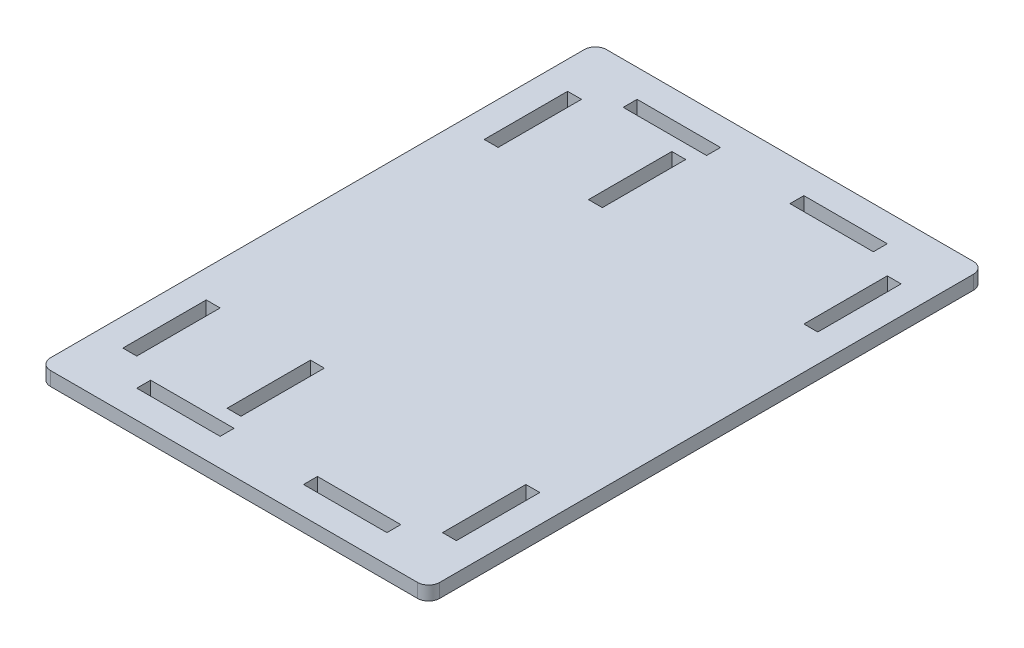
ISO-10303-21;
HEADER;
FILE_DESCRIPTION(('STEP AP214'),'2;1');
FILE_NAME('part.step','',(''),(''),'','','');
FILE_SCHEMA(('AUTOMOTIVE_DESIGN { 1 0 10303 214 1 1 1 1 }'));
ENDSEC;
DATA;
#1=APPLICATION_CONTEXT('core data for automotive mechanical design processes');
#2=APPLICATION_PROTOCOL_DEFINITION('international standard','automotive_design',2000,#1);
#3=PRODUCT_CONTEXT('',#1,'mechanical');
#4=PRODUCT('Part','Part','',(#3));
#5=PRODUCT_RELATED_PRODUCT_CATEGORY('part','',(#4));
#6=PRODUCT_DEFINITION_FORMATION('','',#4);
#7=PRODUCT_DEFINITION_CONTEXT('part definition',#1,'design');
#8=PRODUCT_DEFINITION('design','',#6,#7);
#9=PRODUCT_DEFINITION_SHAPE('','',#8);
#10=(LENGTH_UNIT() NAMED_UNIT(*) SI_UNIT(.MILLI.,.METRE.));
#11=(NAMED_UNIT(*) PLANE_ANGLE_UNIT() SI_UNIT($,.RADIAN.));
#12=(NAMED_UNIT(*) SI_UNIT($,.STERADIAN.) SOLID_ANGLE_UNIT());
#13=UNCERTAINTY_MEASURE_WITH_UNIT(LENGTH_MEASURE(1.E-05),#10,'distance_accuracy_value','');
#14=(GEOMETRIC_REPRESENTATION_CONTEXT(3) GLOBAL_UNCERTAINTY_ASSIGNED_CONTEXT((#13)) GLOBAL_UNIT_ASSIGNED_CONTEXT((#10,
#11,#12)) REPRESENTATION_CONTEXT('',''));
#15=CARTESIAN_POINT('',(0.,0.,0.));
#16=DIRECTION('',(0.,0.,1.));
#17=DIRECTION('',(1.,0.,0.));
#18=AXIS2_PLACEMENT_3D('',#15,#16,#17);
#19=CARTESIAN_POINT('',(0.,3.175,0.));
#20=DIRECTION('',(1.,0.,0.));
#21=DIRECTION('',(0.,0.,-1.));
#22=AXIS2_PLACEMENT_3D('',#19,#20,#21);
#23=PLANE('',#22);
#24=DIRECTION('',(0.,0.,1.));
#25=VECTOR('',#24,1.);
#26=CARTESIAN_POINT('',(0.,0.,0.));
#27=LINE('',#26,#25);
#28=CARTESIAN_POINT('',(0.,0.,-124.46));
#29=VERTEX_POINT('',#28);
#30=CARTESIAN_POINT('',(0.,0.,-2.54));
#31=VERTEX_POINT('',#30);
#32=EDGE_CURVE('E664',#29,#31,#27,.T.);
#33=ORIENTED_EDGE('',*,*,#32,.T.);
#34=DIRECTION('',(0.,-1.,0.));
#35=VECTOR('',#34,1.);
#36=CARTESIAN_POINT('',(0.,3.175,-2.54));
#37=LINE('',#36,#35);
#38=CARTESIAN_POINT('',(0.,3.175,-2.54));
#39=VERTEX_POINT('',#38);
#40=EDGE_CURVE('E707',#31,#39,#37,.F.);
#41=ORIENTED_EDGE('',*,*,#40,.T.);
#42=DIRECTION('',(0.,0.,1.));
#43=VECTOR('',#42,1.);
#44=CARTESIAN_POINT('',(0.,3.175,0.));
#45=LINE('',#44,#43);
#46=CARTESIAN_POINT('',(0.,3.175,-124.46));
#47=VERTEX_POINT('',#46);
#48=EDGE_CURVE('E671',#47,#39,#45,.T.);
#49=ORIENTED_EDGE('',*,*,#48,.F.);
#50=DIRECTION('',(0.,-1.,0.));
#51=VECTOR('',#50,1.);
#52=CARTESIAN_POINT('',(0.,3.175,-124.46));
#53=LINE('',#52,#51);
#54=EDGE_CURVE('E704',#47,#29,#53,.T.);
#55=ORIENTED_EDGE('',*,*,#54,.T.);
#56=EDGE_LOOP('',(#33,#41,#49,#55));
#57=FACE_BOUND('',#56,.T.);
#58=ADVANCED_FACE('F33',(#57),#23,.F.);
#59=CARTESIAN_POINT('',(0.,3.175,0.));
#60=DIRECTION('',(0.,0.,-1.));
#61=DIRECTION('',(-1.,0.,0.));
#62=AXIS2_PLACEMENT_3D('',#59,#60,#61);
#63=PLANE('',#62);
#64=DIRECTION('',(1.,0.,0.));
#65=VECTOR('',#64,1.);
#66=CARTESIAN_POINT('',(0.,3.175,0.));
#67=LINE('',#66,#65);
#68=CARTESIAN_POINT('',(2.54,3.175,0.));
#69=VERTEX_POINT('',#68);
#70=CARTESIAN_POINT('',(86.36,3.175,0.));
#71=VERTEX_POINT('',#70);
#72=EDGE_CURVE('E674',#69,#71,#67,.T.);
#73=ORIENTED_EDGE('',*,*,#72,.F.);
#74=DIRECTION('',(0.,-1.,0.));
#75=VECTOR('',#74,1.);
#76=CARTESIAN_POINT('',(2.54,3.175,0.));
#77=LINE('',#76,#75);
#78=CARTESIAN_POINT('',(2.54,0.,0.));
#79=VERTEX_POINT('',#78);
#80=EDGE_CURVE('E693',#69,#79,#77,.T.);
#81=ORIENTED_EDGE('',*,*,#80,.T.);
#82=DIRECTION('',(1.,0.,0.));
#83=VECTOR('',#82,1.);
#84=CARTESIAN_POINT('',(0.,0.,0.));
#85=LINE('',#84,#83);
#86=CARTESIAN_POINT('',(86.36,0.,0.));
#87=VERTEX_POINT('',#86);
#88=EDGE_CURVE('E685',#79,#87,#85,.T.);
#89=ORIENTED_EDGE('',*,*,#88,.T.);
#90=DIRECTION('',(0.,-1.,0.));
#91=VECTOR('',#90,1.);
#92=CARTESIAN_POINT('',(86.36,3.175,0.));
#93=LINE('',#92,#91);
#94=EDGE_CURVE('E682',#87,#71,#93,.F.);
#95=ORIENTED_EDGE('',*,*,#94,.T.);
#96=EDGE_LOOP('',(#73,#81,#89,#95));
#97=FACE_BOUND('',#96,.T.);
#98=ADVANCED_FACE('F749',(#97),#63,.F.);
#99=CARTESIAN_POINT('',(88.9,3.175,0.));
#100=DIRECTION('',(-1.,0.,0.));
#101=DIRECTION('',(0.,0.,1.));
#102=AXIS2_PLACEMENT_3D('',#99,#100,#101);
#103=PLANE('',#102);
#104=DIRECTION('',(0.,0.,-1.));
#105=VECTOR('',#104,1.);
#106=CARTESIAN_POINT('',(88.9,3.175,0.));
#107=LINE('',#106,#105);
#108=CARTESIAN_POINT('',(88.9,3.175,-2.54));
#109=VERTEX_POINT('',#108);
#110=CARTESIAN_POINT('',(88.9,3.175,-124.46));
#111=VERTEX_POINT('',#110);
#112=EDGE_CURVE('E678',#109,#111,#107,.T.);
#113=ORIENTED_EDGE('',*,*,#112,.F.);
#114=DIRECTION('',(0.,-1.,0.));
#115=VECTOR('',#114,1.);
#116=CARTESIAN_POINT('',(88.9,3.175,-2.54));
#117=LINE('',#116,#115);
#118=CARTESIAN_POINT('',(88.9,0.,-2.54));
#119=VERTEX_POINT('',#118);
#120=EDGE_CURVE('E718',#109,#119,#117,.T.);
#121=ORIENTED_EDGE('',*,*,#120,.T.);
#122=DIRECTION('',(0.,0.,-1.));
#123=VECTOR('',#122,1.);
#124=CARTESIAN_POINT('',(88.9,0.,0.));
#125=LINE('',#124,#123);
#126=CARTESIAN_POINT('',(88.9,0.,-124.46));
#127=VERTEX_POINT('',#126);
#128=EDGE_CURVE('E688',#119,#127,#125,.T.);
#129=ORIENTED_EDGE('',*,*,#128,.T.);
#130=DIRECTION('',(0.,-1.,0.));
#131=VECTOR('',#130,1.);
#132=CARTESIAN_POINT('',(88.9,3.175,-124.46));
#133=LINE('',#132,#131);
#134=EDGE_CURVE('E716',#127,#111,#133,.F.);
#135=ORIENTED_EDGE('',*,*,#134,.T.);
#136=EDGE_LOOP('',(#113,#121,#129,#135));
#137=FACE_BOUND('',#136,.T.);
#138=ADVANCED_FACE('F724',(#137),#103,.F.);
#139=CARTESIAN_POINT('',(88.9,3.175,-127.));
#140=DIRECTION('',(0.,0.,1.));
#141=DIRECTION('',(1.,0.,0.));
#142=AXIS2_PLACEMENT_3D('',#139,#140,#141);
#143=PLANE('',#142);
#144=DIRECTION('',(-1.,0.,0.));
#145=VECTOR('',#144,1.);
#146=CARTESIAN_POINT('',(88.9,3.175,-127.));
#147=LINE('',#146,#145);
#148=CARTESIAN_POINT('',(86.36,3.175,-127.));
#149=VERTEX_POINT('',#148);
#150=CARTESIAN_POINT('',(2.54,3.175,-127.));
#151=VERTEX_POINT('',#150);
#152=EDGE_CURVE('E680',#149,#151,#147,.T.);
#153=ORIENTED_EDGE('',*,*,#152,.F.);
#154=DIRECTION('',(0.,-1.,0.));
#155=VECTOR('',#154,1.);
#156=CARTESIAN_POINT('',(86.36,3.175,-127.));
#157=LINE('',#156,#155);
#158=CARTESIAN_POINT('',(86.36,0.,-127.));
#159=VERTEX_POINT('',#158);
#160=EDGE_CURVE('E11',#149,#159,#157,.T.);
#161=ORIENTED_EDGE('',*,*,#160,.T.);
#162=DIRECTION('',(-1.,0.,0.));
#163=VECTOR('',#162,1.);
#164=CARTESIAN_POINT('',(88.9,0.,-127.));
#165=LINE('',#164,#163);
#166=CARTESIAN_POINT('',(2.54,0.,-127.));
#167=VERTEX_POINT('',#166);
#168=EDGE_CURVE('E675',#159,#167,#165,.T.);
#169=ORIENTED_EDGE('',*,*,#168,.T.);
#170=DIRECTION('',(0.,-1.,0.));
#171=VECTOR('',#170,1.);
#172=CARTESIAN_POINT('',(2.54,3.175,-127.));
#173=LINE('',#172,#171);
#174=EDGE_CURVE('E41',#167,#151,#173,.F.);
#175=ORIENTED_EDGE('',*,*,#174,.T.);
#176=EDGE_LOOP('',(#153,#161,#169,#175));
#177=FACE_BOUND('',#176,.T.);
#178=ADVANCED_FACE('F734',(#177),#143,.F.);
#179=CARTESIAN_POINT('',(0.,3.175,0.));
#180=DIRECTION('',(0.,1.,0.));
#181=DIRECTION('',(0.,0.,1.));
#182=AXIS2_PLACEMENT_3D('',#179,#180,#181);
#183=PLANE('',#182);
#184=DIRECTION('',(1.,0.,0.));
#185=VECTOR('',#184,1.);
#186=CARTESIAN_POINT('',(30.1625,3.175,-12.7));
#187=LINE('',#186,#185);
#188=CARTESIAN_POINT('',(30.1625,3.175,-12.7));
#189=VERTEX_POINT('',#188);
#190=CARTESIAN_POINT('',(33.3375,3.175,-12.7));
#191=VERTEX_POINT('',#190);
#192=EDGE_CURVE('E346',#189,#191,#187,.T.);
#193=ORIENTED_EDGE('',*,*,#192,.F.);
#194=DIRECTION('',(0.,0.,1.));
#195=VECTOR('',#194,1.);
#196=CARTESIAN_POINT('',(30.1625,3.175,-12.7));
#197=LINE('',#196,#195);
#198=CARTESIAN_POINT('',(30.1625,3.175,-31.75));
#199=VERTEX_POINT('',#198);
#200=EDGE_CURVE('E364',#199,#189,#197,.T.);
#201=ORIENTED_EDGE('',*,*,#200,.F.);
#202=DIRECTION('',(-1.,0.,0.));
#203=VECTOR('',#202,1.);
#204=CARTESIAN_POINT('',(30.1625,3.175,-31.75));
#205=LINE('',#204,#203);
#206=CARTESIAN_POINT('',(33.3375,3.175,-31.75));
#207=VERTEX_POINT('',#206);
#208=EDGE_CURVE('E367',#207,#199,#205,.T.);
#209=ORIENTED_EDGE('',*,*,#208,.F.);
#210=DIRECTION('',(0.,0.,-1.));
#211=VECTOR('',#210,1.);
#212=CARTESIAN_POINT('',(33.3375,3.175,-12.7));
#213=LINE('',#212,#211);
#214=EDGE_CURVE('E373',#191,#207,#213,.T.);
#215=ORIENTED_EDGE('',*,*,#214,.F.);
#216=EDGE_LOOP('',(#193,#201,#209,#215));
#217=FACE_BOUND('',#216,.T.);
#218=DIRECTION('',(0.,0.,1.));
#219=VECTOR('',#218,1.);
#220=CARTESIAN_POINT('',(30.1625,3.175,-114.3));
#221=LINE('',#220,#219);
#222=CARTESIAN_POINT('',(30.1625,3.175,-114.3));
#223=VERTEX_POINT('',#222);
#224=CARTESIAN_POINT('',(30.1625,3.175,-95.25));
#225=VERTEX_POINT('',#224);
#226=EDGE_CURVE('E379',#223,#225,#221,.T.);
#227=ORIENTED_EDGE('',*,*,#226,.F.);
#228=DIRECTION('',(-1.,0.,0.));
#229=VECTOR('',#228,1.);
#230=CARTESIAN_POINT('',(30.1625,3.175,-114.3));
#231=LINE('',#230,#229);
#232=CARTESIAN_POINT('',(33.3375,3.175,-114.3));
#233=VERTEX_POINT('',#232);
#234=EDGE_CURVE('E387',#233,#223,#231,.T.);
#235=ORIENTED_EDGE('',*,*,#234,.F.);
#236=DIRECTION('',(0.,0.,-1.));
#237=VECTOR('',#236,1.);
#238=CARTESIAN_POINT('',(33.3375,3.175,-114.3));
#239=LINE('',#238,#237);
#240=CARTESIAN_POINT('',(33.3375,3.175,-95.25));
#241=VERTEX_POINT('',#240);
#242=EDGE_CURVE('E401',#241,#233,#239,.T.);
#243=ORIENTED_EDGE('',*,*,#242,.F.);
#244=DIRECTION('',(1.,0.,0.));
#245=VECTOR('',#244,1.);
#246=CARTESIAN_POINT('',(30.1625,3.175,-95.25));
#247=LINE('',#246,#245);
#248=EDGE_CURVE('E398',#225,#241,#247,.T.);
#249=ORIENTED_EDGE('',*,*,#248,.F.);
#250=EDGE_LOOP('',(#227,#235,#243,#249));
#251=FACE_BOUND('',#250,.T.);
#252=DIRECTION('',(1.,0.,0.));
#253=VECTOR('',#252,1.);
#254=CARTESIAN_POINT('',(15.875,3.175,-6.35000000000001));
#255=LINE('',#254,#253);
#256=CARTESIAN_POINT('',(15.875,3.175,-6.35000000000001));
#257=VERTEX_POINT('',#256);
#258=CARTESIAN_POINT('',(34.925,3.175,-6.35000000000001));
#259=VERTEX_POINT('',#258);
#260=EDGE_CURVE('E408',#257,#259,#255,.T.);
#261=ORIENTED_EDGE('',*,*,#260,.F.);
#262=DIRECTION('',(0.,0.,1.));
#263=VECTOR('',#262,1.);
#264=CARTESIAN_POINT('',(15.875,3.175,-6.35000000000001));
#265=LINE('',#264,#263);
#266=CARTESIAN_POINT('',(15.875,3.175,-9.52500000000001));
#267=VERTEX_POINT('',#266);
#268=EDGE_CURVE('E419',#267,#257,#265,.T.);
#269=ORIENTED_EDGE('',*,*,#268,.F.);
#270=DIRECTION('',(-1.,0.,0.));
#271=VECTOR('',#270,1.);
#272=CARTESIAN_POINT('',(15.875,3.175,-9.52500000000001));
#273=LINE('',#272,#271);
#274=CARTESIAN_POINT('',(34.925,3.175,-9.52500000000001));
#275=VERTEX_POINT('',#274);
#276=EDGE_CURVE('E433',#275,#267,#273,.T.);
#277=ORIENTED_EDGE('',*,*,#276,.F.);
#278=DIRECTION('',(0.,0.,-1.));
#279=VECTOR('',#278,1.);
#280=CARTESIAN_POINT('',(34.925,3.175,-6.35000000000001));
#281=LINE('',#280,#279);
#282=EDGE_CURVE('E430',#259,#275,#281,.T.);
#283=ORIENTED_EDGE('',*,*,#282,.F.);
#284=EDGE_LOOP('',(#261,#269,#277,#283));
#285=FACE_BOUND('',#284,.T.);
#286=DIRECTION('',(0.,0.,-1.));
#287=VECTOR('',#286,1.);
#288=CARTESIAN_POINT('',(73.025,3.175,-6.35000000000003));
#289=LINE('',#288,#287);
#290=CARTESIAN_POINT('',(73.025,3.175,-6.35000000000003));
#291=VERTEX_POINT('',#290);
#292=CARTESIAN_POINT('',(73.025,3.175,-9.52500000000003));
#293=VERTEX_POINT('',#292);
#294=EDGE_CURVE('E440',#291,#293,#289,.T.);
#295=ORIENTED_EDGE('',*,*,#294,.F.);
#296=DIRECTION('',(1.,0.,0.));
#297=VECTOR('',#296,1.);
#298=CARTESIAN_POINT('',(73.025,3.175,-6.35000000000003));
#299=LINE('',#298,#297);
#300=CARTESIAN_POINT('',(53.975,3.175,-6.35000000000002));
#301=VERTEX_POINT('',#300);
#302=EDGE_CURVE('E451',#301,#291,#299,.T.);
#303=ORIENTED_EDGE('',*,*,#302,.F.);
#304=DIRECTION('',(0.,0.,1.));
#305=VECTOR('',#304,1.);
#306=CARTESIAN_POINT('',(53.975,3.175,-6.35000000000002));
#307=LINE('',#306,#305);
#308=CARTESIAN_POINT('',(53.975,3.175,-9.52500000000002));
#309=VERTEX_POINT('',#308);
#310=EDGE_CURVE('E465',#309,#301,#307,.T.);
#311=ORIENTED_EDGE('',*,*,#310,.F.);
#312=DIRECTION('',(-1.,0.,0.));
#313=VECTOR('',#312,1.);
#314=CARTESIAN_POINT('',(73.025,3.175,-9.52500000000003));
#315=LINE('',#314,#313);
#316=EDGE_CURVE('E462',#293,#309,#315,.T.);
#317=ORIENTED_EDGE('',*,*,#316,.F.);
#318=EDGE_LOOP('',(#295,#303,#311,#317));
#319=FACE_BOUND('',#318,.T.);
#320=DIRECTION('',(-1.,0.,0.));
#321=VECTOR('',#320,1.);
#322=CARTESIAN_POINT('',(73.025,3.175,-120.65));
#323=LINE('',#322,#321);
#324=CARTESIAN_POINT('',(73.025,3.175,-120.65));
#325=VERTEX_POINT('',#324);
#326=CARTESIAN_POINT('',(53.975,3.175,-120.65));
#327=VERTEX_POINT('',#326);
#328=EDGE_CURVE('E472',#325,#327,#323,.T.);
#329=ORIENTED_EDGE('',*,*,#328,.F.);
#330=DIRECTION('',(0.,0.,-1.));
#331=VECTOR('',#330,1.);
#332=CARTESIAN_POINT('',(73.025,3.175,-120.65));
#333=LINE('',#332,#331);
#334=CARTESIAN_POINT('',(73.025,3.175,-117.475));
#335=VERTEX_POINT('',#334);
#336=EDGE_CURVE('E483',#335,#325,#333,.T.);
#337=ORIENTED_EDGE('',*,*,#336,.F.);
#338=DIRECTION('',(1.,0.,0.));
#339=VECTOR('',#338,1.);
#340=CARTESIAN_POINT('',(73.025,3.175,-117.475));
#341=LINE('',#340,#339);
#342=CARTESIAN_POINT('',(53.975,3.175,-117.475));
#343=VERTEX_POINT('',#342);
#344=EDGE_CURVE('E497',#343,#335,#341,.T.);
#345=ORIENTED_EDGE('',*,*,#344,.F.);
#346=DIRECTION('',(0.,0.,1.));
#347=VECTOR('',#346,1.);
#348=CARTESIAN_POINT('',(53.975,3.175,-120.65));
#349=LINE('',#348,#347);
#350=EDGE_CURVE('E494',#327,#343,#349,.T.);
#351=ORIENTED_EDGE('',*,*,#350,.F.);
#352=EDGE_LOOP('',(#329,#337,#345,#351));
#353=FACE_BOUND('',#352,.T.);
#354=DIRECTION('',(0.,0.,1.));
#355=VECTOR('',#354,1.);
#356=CARTESIAN_POINT('',(15.875,3.175,-120.65));
#357=LINE('',#356,#355);
#358=CARTESIAN_POINT('',(15.875,3.175,-120.65));
#359=VERTEX_POINT('',#358);
#360=CARTESIAN_POINT('',(15.875,3.175,-117.475));
#361=VERTEX_POINT('',#360);
#362=EDGE_CURVE('E504',#359,#361,#357,.T.);
#363=ORIENTED_EDGE('',*,*,#362,.F.);
#364=DIRECTION('',(-1.,0.,0.));
#365=VECTOR('',#364,1.);
#366=CARTESIAN_POINT('',(15.875,3.175,-120.65));
#367=LINE('',#366,#365);
#368=CARTESIAN_POINT('',(34.925,3.175,-120.65));
#369=VERTEX_POINT('',#368);
#370=EDGE_CURVE('E515',#369,#359,#367,.T.);
#371=ORIENTED_EDGE('',*,*,#370,.F.);
#372=DIRECTION('',(0.,0.,-1.));
#373=VECTOR('',#372,1.);
#374=CARTESIAN_POINT('',(34.925,3.175,-120.65));
#375=LINE('',#374,#373);
#376=CARTESIAN_POINT('',(34.925,3.175,-117.475));
#377=VERTEX_POINT('',#376);
#378=EDGE_CURVE('E529',#377,#369,#375,.T.);
#379=ORIENTED_EDGE('',*,*,#378,.F.);
#380=DIRECTION('',(1.,0.,0.));
#381=VECTOR('',#380,1.);
#382=CARTESIAN_POINT('',(15.875,3.175,-117.475));
#383=LINE('',#382,#381);
#384=EDGE_CURVE('E526',#361,#377,#383,.T.);
#385=ORIENTED_EDGE('',*,*,#384,.F.);
#386=EDGE_LOOP('',(#363,#371,#379,#385));
#387=FACE_BOUND('',#386,.T.);
#388=DIRECTION('',(1.,0.,0.));
#389=VECTOR('',#388,1.);
#390=CARTESIAN_POINT('',(6.35000000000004,3.175,-12.7));
#391=LINE('',#390,#389);
#392=CARTESIAN_POINT('',(6.35000000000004,3.175,-12.7));
#393=VERTEX_POINT('',#392);
#394=CARTESIAN_POINT('',(9.52500000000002,3.175,-12.7));
#395=VERTEX_POINT('',#394);
#396=EDGE_CURVE('E536',#393,#395,#391,.T.);
#397=ORIENTED_EDGE('',*,*,#396,.F.);
#398=DIRECTION('',(0.,0.,1.));
#399=VECTOR('',#398,1.);
#400=CARTESIAN_POINT('',(6.35000000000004,3.175,-12.7));
#401=LINE('',#400,#399);
#402=CARTESIAN_POINT('',(6.35000000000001,3.175,-31.75));
#403=VERTEX_POINT('',#402);
#404=EDGE_CURVE('E547',#403,#393,#401,.T.);
#405=ORIENTED_EDGE('',*,*,#404,.F.);
#406=DIRECTION('',(-1.,0.,0.));
#407=VECTOR('',#406,1.);
#408=CARTESIAN_POINT('',(6.35000000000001,3.175,-31.75));
#409=LINE('',#408,#407);
#410=CARTESIAN_POINT('',(9.52500000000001,3.175,-31.75));
#411=VERTEX_POINT('',#410);
#412=EDGE_CURVE('E561',#411,#403,#409,.T.);
#413=ORIENTED_EDGE('',*,*,#412,.F.);
#414=DIRECTION('',(0.,0.,-1.));
#415=VECTOR('',#414,1.);
#416=CARTESIAN_POINT('',(9.52500000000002,3.175,-12.7));
#417=LINE('',#416,#415);
#418=EDGE_CURVE('E558',#395,#411,#417,.T.);
#419=ORIENTED_EDGE('',*,*,#418,.F.);
#420=EDGE_LOOP('',(#397,#405,#413,#419));
#421=FACE_BOUND('',#420,.T.);
#422=DIRECTION('',(0.,0.,-1.));
#423=VECTOR('',#422,1.);
#424=CARTESIAN_POINT('',(82.55,3.175,-12.7));
#425=LINE('',#424,#423);
#426=CARTESIAN_POINT('',(82.55,3.175,-12.7));
#427=VERTEX_POINT('',#426);
#428=CARTESIAN_POINT('',(82.55,3.175,-31.75));
#429=VERTEX_POINT('',#428);
#430=EDGE_CURVE('E568',#427,#429,#425,.T.);
#431=ORIENTED_EDGE('',*,*,#430,.F.);
#432=DIRECTION('',(1.,0.,0.));
#433=VECTOR('',#432,1.);
#434=CARTESIAN_POINT('',(82.55,3.175,-12.7));
#435=LINE('',#434,#433);
#436=CARTESIAN_POINT('',(79.375,3.175,-12.7));
#437=VERTEX_POINT('',#436);
#438=EDGE_CURVE('E579',#437,#427,#435,.T.);
#439=ORIENTED_EDGE('',*,*,#438,.F.);
#440=DIRECTION('',(0.,0.,1.));
#441=VECTOR('',#440,1.);
#442=CARTESIAN_POINT('',(79.375,3.175,-12.7));
#443=LINE('',#442,#441);
#444=CARTESIAN_POINT('',(79.375,3.175,-31.75));
#445=VERTEX_POINT('',#444);
#446=EDGE_CURVE('E593',#445,#437,#443,.T.);
#447=ORIENTED_EDGE('',*,*,#446,.F.);
#448=DIRECTION('',(-1.,0.,0.));
#449=VECTOR('',#448,1.);
#450=CARTESIAN_POINT('',(82.55,3.175,-31.75));
#451=LINE('',#450,#449);
#452=EDGE_CURVE('E590',#429,#445,#451,.T.);
#453=ORIENTED_EDGE('',*,*,#452,.F.);
#454=EDGE_LOOP('',(#431,#439,#447,#453));
#455=FACE_BOUND('',#454,.T.);
#456=DIRECTION('',(-1.,0.,0.));
#457=VECTOR('',#456,1.);
#458=CARTESIAN_POINT('',(82.55,3.175,-114.3));
#459=LINE('',#458,#457);
#460=CARTESIAN_POINT('',(82.55,3.175,-114.3));
#461=VERTEX_POINT('',#460);
#462=CARTESIAN_POINT('',(79.375,3.175,-114.3));
#463=VERTEX_POINT('',#462);
#464=EDGE_CURVE('E600',#461,#463,#459,.T.);
#465=ORIENTED_EDGE('',*,*,#464,.F.);
#466=DIRECTION('',(0.,0.,-1.));
#467=VECTOR('',#466,1.);
#468=CARTESIAN_POINT('',(82.55,3.175,-114.3));
#469=LINE('',#468,#467);
#470=CARTESIAN_POINT('',(82.55,3.175,-95.25));
#471=VERTEX_POINT('',#470);
#472=EDGE_CURVE('E611',#471,#461,#469,.T.);
#473=ORIENTED_EDGE('',*,*,#472,.F.);
#474=DIRECTION('',(1.,0.,0.));
#475=VECTOR('',#474,1.);
#476=CARTESIAN_POINT('',(82.55,3.175,-95.25));
#477=LINE('',#476,#475);
#478=CARTESIAN_POINT('',(79.375,3.175,-95.25));
#479=VERTEX_POINT('',#478);
#480=EDGE_CURVE('E625',#479,#471,#477,.T.);
#481=ORIENTED_EDGE('',*,*,#480,.F.);
#482=DIRECTION('',(0.,0.,1.));
#483=VECTOR('',#482,1.);
#484=CARTESIAN_POINT('',(79.375,3.175,-114.3));
#485=LINE('',#484,#483);
#486=EDGE_CURVE('E622',#463,#479,#485,.T.);
#487=ORIENTED_EDGE('',*,*,#486,.F.);
#488=EDGE_LOOP('',(#465,#473,#481,#487));
#489=FACE_BOUND('',#488,.T.);
#490=DIRECTION('',(0.,0.,1.));
#491=VECTOR('',#490,1.);
#492=CARTESIAN_POINT('',(6.35,3.175,-114.3));
#493=LINE('',#492,#491);
#494=CARTESIAN_POINT('',(6.35,3.175,-114.3));
#495=VERTEX_POINT('',#494);
#496=CARTESIAN_POINT('',(6.35,3.175,-95.25));
#497=VERTEX_POINT('',#496);
#498=EDGE_CURVE('E632',#495,#497,#493,.T.);
#499=ORIENTED_EDGE('',*,*,#498,.F.);
#500=DIRECTION('',(-1.,0.,0.));
#501=VECTOR('',#500,1.);
#502=CARTESIAN_POINT('',(6.35,3.175,-114.3));
#503=LINE('',#502,#501);
#504=CARTESIAN_POINT('',(9.525,3.175,-114.3));
#505=VERTEX_POINT('',#504);
#506=EDGE_CURVE('E643',#505,#495,#503,.T.);
#507=ORIENTED_EDGE('',*,*,#506,.F.);
#508=DIRECTION('',(0.,0.,-1.));
#509=VECTOR('',#508,1.);
#510=CARTESIAN_POINT('',(9.525,3.175,-114.3));
#511=LINE('',#510,#509);
#512=CARTESIAN_POINT('',(9.525,3.175,-95.2499999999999));
#513=VERTEX_POINT('',#512);
#514=EDGE_CURVE('E657',#513,#505,#511,.T.);
#515=ORIENTED_EDGE('',*,*,#514,.F.);
#516=DIRECTION('',(1.,0.,0.));
#517=VECTOR('',#516,1.);
#518=CARTESIAN_POINT('',(6.35,3.175,-95.25));
#519=LINE('',#518,#517);
#520=EDGE_CURVE('E654',#497,#513,#519,.T.);
#521=ORIENTED_EDGE('',*,*,#520,.F.);
#522=EDGE_LOOP('',(#499,#507,#515,#521));
#523=FACE_BOUND('',#522,.T.);
#524=ORIENTED_EDGE('',*,*,#48,.T.);
#525=CARTESIAN_POINT('',(2.54,3.175,-2.54));
#526=DIRECTION('',(0.,1.,0.));
#527=DIRECTION('',(0.,0.,1.));
#528=AXIS2_PLACEMENT_3D('',#525,#526,#527);
#529=CIRCLE('',#528,2.54);
#530=EDGE_CURVE('E714',#39,#69,#529,.T.);
#531=ORIENTED_EDGE('',*,*,#530,.T.);
#532=ORIENTED_EDGE('',*,*,#72,.T.);
#533=CARTESIAN_POINT('',(86.36,3.175,-2.54));
#534=DIRECTION('',(0.,1.,0.));
#535=DIRECTION('',(0.,0.,1.));
#536=AXIS2_PLACEMENT_3D('',#533,#534,#535);
#537=CIRCLE('',#536,2.54);
#538=EDGE_CURVE('E712',#71,#109,#537,.T.);
#539=ORIENTED_EDGE('',*,*,#538,.T.);
#540=ORIENTED_EDGE('',*,*,#112,.T.);
#541=CARTESIAN_POINT('',(86.36,3.175,-124.46));
#542=DIRECTION('',(0.,1.,0.));
#543=DIRECTION('',(0.,0.,1.));
#544=AXIS2_PLACEMENT_3D('',#541,#542,#543);
#545=CIRCLE('',#544,2.54);
#546=EDGE_CURVE('E54',#111,#149,#545,.T.);
#547=ORIENTED_EDGE('',*,*,#546,.T.);
#548=ORIENTED_EDGE('',*,*,#152,.T.);
#549=CARTESIAN_POINT('',(2.54,3.175,-124.46));
#550=DIRECTION('',(0.,1.,0.));
#551=DIRECTION('',(0.,0.,1.));
#552=AXIS2_PLACEMENT_3D('',#549,#550,#551);
#553=CIRCLE('',#552,2.54);
#554=EDGE_CURVE('E709',#151,#47,#553,.T.);
#555=ORIENTED_EDGE('',*,*,#554,.T.);
#556=EDGE_LOOP('',(#524,#531,#532,#539,#540,#547,#548,#555));
#557=FACE_BOUND('',#556,.T.);
#558=ADVANCED_FACE('F736',(#217,#251,#285,#319,#353,#387,#421,#455,#489,#523,#557),#183,.T.);
#559=CARTESIAN_POINT('',(0.,0.,0.));
#560=DIRECTION('',(0.,1.,0.));
#561=DIRECTION('',(0.,0.,1.));
#562=AXIS2_PLACEMENT_3D('',#559,#560,#561);
#563=PLANE('',#562);
#564=DIRECTION('',(0.,0.,1.));
#565=VECTOR('',#564,1.);
#566=CARTESIAN_POINT('',(30.1625,0.,-12.7));
#567=LINE('',#566,#565);
#568=CARTESIAN_POINT('',(30.1625,0.,-31.75));
#569=VERTEX_POINT('',#568);
#570=CARTESIAN_POINT('',(30.1625,0.,-12.7));
#571=VERTEX_POINT('',#570);
#572=EDGE_CURVE('E351',#569,#571,#567,.T.);
#573=ORIENTED_EDGE('',*,*,#572,.T.);
#574=DIRECTION('',(1.,0.,0.));
#575=VECTOR('',#574,1.);
#576=CARTESIAN_POINT('',(30.1625,0.,-12.7));
#577=LINE('',#576,#575);
#578=CARTESIAN_POINT('',(33.3375,0.,-12.7));
#579=VERTEX_POINT('',#578);
#580=EDGE_CURVE('E343',#571,#579,#577,.T.);
#581=ORIENTED_EDGE('',*,*,#580,.T.);
#582=DIRECTION('',(0.,0.,-1.));
#583=VECTOR('',#582,1.);
#584=CARTESIAN_POINT('',(33.3375,0.,-12.7));
#585=LINE('',#584,#583);
#586=CARTESIAN_POINT('',(33.3375,0.,-31.75));
#587=VERTEX_POINT('',#586);
#588=EDGE_CURVE('E355',#579,#587,#585,.T.);
#589=ORIENTED_EDGE('',*,*,#588,.T.);
#590=DIRECTION('',(-1.,0.,0.));
#591=VECTOR('',#590,1.);
#592=CARTESIAN_POINT('',(30.1625,0.,-31.75));
#593=LINE('',#592,#591);
#594=EDGE_CURVE('E359',#587,#569,#593,.T.);
#595=ORIENTED_EDGE('',*,*,#594,.T.);
#596=EDGE_LOOP('',(#573,#581,#589,#595));
#597=FACE_BOUND('',#596,.T.);
#598=DIRECTION('',(-1.,0.,0.));
#599=VECTOR('',#598,1.);
#600=CARTESIAN_POINT('',(30.1625,0.,-114.3));
#601=LINE('',#600,#599);
#602=CARTESIAN_POINT('',(33.3375,0.,-114.3));
#603=VERTEX_POINT('',#602);
#604=CARTESIAN_POINT('',(30.1625,0.,-114.3));
#605=VERTEX_POINT('',#604);
#606=EDGE_CURVE('E393',#603,#605,#601,.T.);
#607=ORIENTED_EDGE('',*,*,#606,.T.);
#608=DIRECTION('',(0.,0.,1.));
#609=VECTOR('',#608,1.);
#610=CARTESIAN_POINT('',(30.1625,0.,-114.3));
#611=LINE('',#610,#609);
#612=CARTESIAN_POINT('',(30.1625,0.,-95.25));
#613=VERTEX_POINT('',#612);
#614=EDGE_CURVE('E383',#605,#613,#611,.T.);
#615=ORIENTED_EDGE('',*,*,#614,.T.);
#616=DIRECTION('',(1.,0.,0.));
#617=VECTOR('',#616,1.);
#618=CARTESIAN_POINT('',(30.1625,0.,-95.25));
#619=LINE('',#618,#617);
#620=CARTESIAN_POINT('',(33.3375,0.,-95.25));
#621=VERTEX_POINT('',#620);
#622=EDGE_CURVE('E386',#613,#621,#619,.T.);
#623=ORIENTED_EDGE('',*,*,#622,.T.);
#624=DIRECTION('',(0.,0.,-1.));
#625=VECTOR('',#624,1.);
#626=CARTESIAN_POINT('',(33.3375,0.,-114.3));
#627=LINE('',#626,#625);
#628=EDGE_CURVE('E390',#621,#603,#627,.T.);
#629=ORIENTED_EDGE('',*,*,#628,.T.);
#630=EDGE_LOOP('',(#607,#615,#623,#629));
#631=FACE_BOUND('',#630,.T.);
#632=DIRECTION('',(0.,0.,1.));
#633=VECTOR('',#632,1.);
#634=CARTESIAN_POINT('',(15.875,0.,-6.35000000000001));
#635=LINE('',#634,#633);
#636=CARTESIAN_POINT('',(15.875,0.,-9.52500000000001));
#637=VERTEX_POINT('',#636);
#638=CARTESIAN_POINT('',(15.875,0.,-6.35000000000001));
#639=VERTEX_POINT('',#638);
#640=EDGE_CURVE('E425',#637,#639,#635,.T.);
#641=ORIENTED_EDGE('',*,*,#640,.T.);
#642=DIRECTION('',(1.,0.,0.));
#643=VECTOR('',#642,1.);
#644=CARTESIAN_POINT('',(15.875,0.,-6.35000000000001));
#645=LINE('',#644,#643);
#646=CARTESIAN_POINT('',(34.925,0.,-6.35000000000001));
#647=VERTEX_POINT('',#646);
#648=EDGE_CURVE('E415',#639,#647,#645,.T.);
#649=ORIENTED_EDGE('',*,*,#648,.T.);
#650=DIRECTION('',(0.,0.,-1.));
#651=VECTOR('',#650,1.);
#652=CARTESIAN_POINT('',(34.925,0.,-6.35000000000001));
#653=LINE('',#652,#651);
#654=CARTESIAN_POINT('',(34.925,0.,-9.52500000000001));
#655=VERTEX_POINT('',#654);
#656=EDGE_CURVE('E418',#647,#655,#653,.T.);
#657=ORIENTED_EDGE('',*,*,#656,.T.);
#658=DIRECTION('',(-1.,0.,0.));
#659=VECTOR('',#658,1.);
#660=CARTESIAN_POINT('',(15.875,0.,-9.52500000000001));
#661=LINE('',#660,#659);
#662=EDGE_CURVE('E422',#655,#637,#661,.T.);
#663=ORIENTED_EDGE('',*,*,#662,.T.);
#664=EDGE_LOOP('',(#641,#649,#657,#663));
#665=FACE_BOUND('',#664,.T.);
#666=DIRECTION('',(1.,0.,0.));
#667=VECTOR('',#666,1.);
#668=CARTESIAN_POINT('',(73.025,0.,-6.35000000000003));
#669=LINE('',#668,#667);
#670=CARTESIAN_POINT('',(53.975,0.,-6.35000000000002));
#671=VERTEX_POINT('',#670);
#672=CARTESIAN_POINT('',(73.025,0.,-6.35000000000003));
#673=VERTEX_POINT('',#672);
#674=EDGE_CURVE('E457',#671,#673,#669,.T.);
#675=ORIENTED_EDGE('',*,*,#674,.T.);
#676=DIRECTION('',(0.,0.,-1.));
#677=VECTOR('',#676,1.);
#678=CARTESIAN_POINT('',(73.025,0.,-6.35000000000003));
#679=LINE('',#678,#677);
#680=CARTESIAN_POINT('',(73.025,0.,-9.52500000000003));
#681=VERTEX_POINT('',#680);
#682=EDGE_CURVE('E447',#673,#681,#679,.T.);
#683=ORIENTED_EDGE('',*,*,#682,.T.);
#684=DIRECTION('',(-1.,0.,0.));
#685=VECTOR('',#684,1.);
#686=CARTESIAN_POINT('',(73.025,0.,-9.52500000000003));
#687=LINE('',#686,#685);
#688=CARTESIAN_POINT('',(53.975,0.,-9.52500000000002));
#689=VERTEX_POINT('',#688);
#690=EDGE_CURVE('E450',#681,#689,#687,.T.);
#691=ORIENTED_EDGE('',*,*,#690,.T.);
#692=DIRECTION('',(0.,0.,1.));
#693=VECTOR('',#692,1.);
#694=CARTESIAN_POINT('',(53.975,0.,-6.35000000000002));
#695=LINE('',#694,#693);
#696=EDGE_CURVE('E454',#689,#671,#695,.T.);
#697=ORIENTED_EDGE('',*,*,#696,.T.);
#698=EDGE_LOOP('',(#675,#683,#691,#697));
#699=FACE_BOUND('',#698,.T.);
#700=DIRECTION('',(0.,0.,-1.));
#701=VECTOR('',#700,1.);
#702=CARTESIAN_POINT('',(73.025,0.,-120.65));
#703=LINE('',#702,#701);
#704=CARTESIAN_POINT('',(73.025,0.,-117.475));
#705=VERTEX_POINT('',#704);
#706=CARTESIAN_POINT('',(73.025,0.,-120.65));
#707=VERTEX_POINT('',#706);
#708=EDGE_CURVE('E489',#705,#707,#703,.T.);
#709=ORIENTED_EDGE('',*,*,#708,.T.);
#710=DIRECTION('',(-1.,0.,0.));
#711=VECTOR('',#710,1.);
#712=CARTESIAN_POINT('',(73.025,0.,-120.65));
#713=LINE('',#712,#711);
#714=CARTESIAN_POINT('',(53.975,0.,-120.65));
#715=VERTEX_POINT('',#714);
#716=EDGE_CURVE('E479',#707,#715,#713,.T.);
#717=ORIENTED_EDGE('',*,*,#716,.T.);
#718=DIRECTION('',(0.,0.,1.));
#719=VECTOR('',#718,1.);
#720=CARTESIAN_POINT('',(53.975,0.,-120.65));
#721=LINE('',#720,#719);
#722=CARTESIAN_POINT('',(53.975,0.,-117.475));
#723=VERTEX_POINT('',#722);
#724=EDGE_CURVE('E482',#715,#723,#721,.T.);
#725=ORIENTED_EDGE('',*,*,#724,.T.);
#726=DIRECTION('',(1.,0.,0.));
#727=VECTOR('',#726,1.);
#728=CARTESIAN_POINT('',(73.025,0.,-117.475));
#729=LINE('',#728,#727);
#730=EDGE_CURVE('E486',#723,#705,#729,.T.);
#731=ORIENTED_EDGE('',*,*,#730,.T.);
#732=EDGE_LOOP('',(#709,#717,#725,#731));
#733=FACE_BOUND('',#732,.T.);
#734=DIRECTION('',(-1.,0.,0.));
#735=VECTOR('',#734,1.);
#736=CARTESIAN_POINT('',(15.875,0.,-120.65));
#737=LINE('',#736,#735);
#738=CARTESIAN_POINT('',(34.925,0.,-120.65));
#739=VERTEX_POINT('',#738);
#740=CARTESIAN_POINT('',(15.875,0.,-120.65));
#741=VERTEX_POINT('',#740);
#742=EDGE_CURVE('E521',#739,#741,#737,.T.);
#743=ORIENTED_EDGE('',*,*,#742,.T.);
#744=DIRECTION('',(0.,0.,1.));
#745=VECTOR('',#744,1.);
#746=CARTESIAN_POINT('',(15.875,0.,-120.65));
#747=LINE('',#746,#745);
#748=CARTESIAN_POINT('',(15.875,0.,-117.475));
#749=VERTEX_POINT('',#748);
#750=EDGE_CURVE('E511',#741,#749,#747,.T.);
#751=ORIENTED_EDGE('',*,*,#750,.T.);
#752=DIRECTION('',(1.,0.,0.));
#753=VECTOR('',#752,1.);
#754=CARTESIAN_POINT('',(15.875,0.,-117.475));
#755=LINE('',#754,#753);
#756=CARTESIAN_POINT('',(34.925,0.,-117.475));
#757=VERTEX_POINT('',#756);
#758=EDGE_CURVE('E514',#749,#757,#755,.T.);
#759=ORIENTED_EDGE('',*,*,#758,.T.);
#760=DIRECTION('',(0.,0.,-1.));
#761=VECTOR('',#760,1.);
#762=CARTESIAN_POINT('',(34.925,0.,-120.65));
#763=LINE('',#762,#761);
#764=EDGE_CURVE('E518',#757,#739,#763,.T.);
#765=ORIENTED_EDGE('',*,*,#764,.T.);
#766=EDGE_LOOP('',(#743,#751,#759,#765));
#767=FACE_BOUND('',#766,.T.);
#768=DIRECTION('',(0.,0.,1.));
#769=VECTOR('',#768,1.);
#770=CARTESIAN_POINT('',(6.35000000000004,0.,-12.7));
#771=LINE('',#770,#769);
#772=CARTESIAN_POINT('',(6.35000000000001,0.,-31.75));
#773=VERTEX_POINT('',#772);
#774=CARTESIAN_POINT('',(6.35000000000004,0.,-12.7));
#775=VERTEX_POINT('',#774);
#776=EDGE_CURVE('E553',#773,#775,#771,.T.);
#777=ORIENTED_EDGE('',*,*,#776,.T.);
#778=DIRECTION('',(1.,0.,0.));
#779=VECTOR('',#778,1.);
#780=CARTESIAN_POINT('',(6.35000000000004,0.,-12.7));
#781=LINE('',#780,#779);
#782=CARTESIAN_POINT('',(9.52500000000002,0.,-12.7));
#783=VERTEX_POINT('',#782);
#784=EDGE_CURVE('E543',#775,#783,#781,.T.);
#785=ORIENTED_EDGE('',*,*,#784,.T.);
#786=DIRECTION('',(0.,0.,-1.));
#787=VECTOR('',#786,1.);
#788=CARTESIAN_POINT('',(9.52500000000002,0.,-12.7));
#789=LINE('',#788,#787);
#790=CARTESIAN_POINT('',(9.52500000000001,0.,-31.75));
#791=VERTEX_POINT('',#790);
#792=EDGE_CURVE('E546',#783,#791,#789,.T.);
#793=ORIENTED_EDGE('',*,*,#792,.T.);
#794=DIRECTION('',(-1.,0.,0.));
#795=VECTOR('',#794,1.);
#796=CARTESIAN_POINT('',(6.35000000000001,0.,-31.75));
#797=LINE('',#796,#795);
#798=EDGE_CURVE('E550',#791,#773,#797,.T.);
#799=ORIENTED_EDGE('',*,*,#798,.T.);
#800=EDGE_LOOP('',(#777,#785,#793,#799));
#801=FACE_BOUND('',#800,.T.);
#802=DIRECTION('',(1.,0.,0.));
#803=VECTOR('',#802,1.);
#804=CARTESIAN_POINT('',(82.55,0.,-12.7));
#805=LINE('',#804,#803);
#806=CARTESIAN_POINT('',(79.375,0.,-12.7));
#807=VERTEX_POINT('',#806);
#808=CARTESIAN_POINT('',(82.55,0.,-12.7));
#809=VERTEX_POINT('',#808);
#810=EDGE_CURVE('E585',#807,#809,#805,.T.);
#811=ORIENTED_EDGE('',*,*,#810,.T.);
#812=DIRECTION('',(0.,0.,-1.));
#813=VECTOR('',#812,1.);
#814=CARTESIAN_POINT('',(82.55,0.,-12.7));
#815=LINE('',#814,#813);
#816=CARTESIAN_POINT('',(82.55,0.,-31.75));
#817=VERTEX_POINT('',#816);
#818=EDGE_CURVE('E575',#809,#817,#815,.T.);
#819=ORIENTED_EDGE('',*,*,#818,.T.);
#820=DIRECTION('',(-1.,0.,0.));
#821=VECTOR('',#820,1.);
#822=CARTESIAN_POINT('',(82.55,0.,-31.75));
#823=LINE('',#822,#821);
#824=CARTESIAN_POINT('',(79.375,0.,-31.75));
#825=VERTEX_POINT('',#824);
#826=EDGE_CURVE('E578',#817,#825,#823,.T.);
#827=ORIENTED_EDGE('',*,*,#826,.T.);
#828=DIRECTION('',(0.,0.,1.));
#829=VECTOR('',#828,1.);
#830=CARTESIAN_POINT('',(79.375,0.,-12.7));
#831=LINE('',#830,#829);
#832=EDGE_CURVE('E582',#825,#807,#831,.T.);
#833=ORIENTED_EDGE('',*,*,#832,.T.);
#834=EDGE_LOOP('',(#811,#819,#827,#833));
#835=FACE_BOUND('',#834,.T.);
#836=DIRECTION('',(0.,0.,-1.));
#837=VECTOR('',#836,1.);
#838=CARTESIAN_POINT('',(82.55,0.,-114.3));
#839=LINE('',#838,#837);
#840=CARTESIAN_POINT('',(82.55,0.,-95.25));
#841=VERTEX_POINT('',#840);
#842=CARTESIAN_POINT('',(82.55,0.,-114.3));
#843=VERTEX_POINT('',#842);
#844=EDGE_CURVE('E617',#841,#843,#839,.T.);
#845=ORIENTED_EDGE('',*,*,#844,.T.);
#846=DIRECTION('',(-1.,0.,0.));
#847=VECTOR('',#846,1.);
#848=CARTESIAN_POINT('',(82.55,0.,-114.3));
#849=LINE('',#848,#847);
#850=CARTESIAN_POINT('',(79.375,0.,-114.3));
#851=VERTEX_POINT('',#850);
#852=EDGE_CURVE('E607',#843,#851,#849,.T.);
#853=ORIENTED_EDGE('',*,*,#852,.T.);
#854=DIRECTION('',(0.,0.,1.));
#855=VECTOR('',#854,1.);
#856=CARTESIAN_POINT('',(79.375,0.,-114.3));
#857=LINE('',#856,#855);
#858=CARTESIAN_POINT('',(79.375,0.,-95.25));
#859=VERTEX_POINT('',#858);
#860=EDGE_CURVE('E610',#851,#859,#857,.T.);
#861=ORIENTED_EDGE('',*,*,#860,.T.);
#862=DIRECTION('',(1.,0.,0.));
#863=VECTOR('',#862,1.);
#864=CARTESIAN_POINT('',(82.55,0.,-95.25));
#865=LINE('',#864,#863);
#866=EDGE_CURVE('E614',#859,#841,#865,.T.);
#867=ORIENTED_EDGE('',*,*,#866,.T.);
#868=EDGE_LOOP('',(#845,#853,#861,#867));
#869=FACE_BOUND('',#868,.T.);
#870=DIRECTION('',(-1.,0.,0.));
#871=VECTOR('',#870,1.);
#872=CARTESIAN_POINT('',(6.35,0.,-114.3));
#873=LINE('',#872,#871);
#874=CARTESIAN_POINT('',(9.525,0.,-114.3));
#875=VERTEX_POINT('',#874);
#876=CARTESIAN_POINT('',(6.35,0.,-114.3));
#877=VERTEX_POINT('',#876);
#878=EDGE_CURVE('E649',#875,#877,#873,.T.);
#879=ORIENTED_EDGE('',*,*,#878,.T.);
#880=DIRECTION('',(0.,0.,1.));
#881=VECTOR('',#880,1.);
#882=CARTESIAN_POINT('',(6.35,0.,-114.3));
#883=LINE('',#882,#881);
#884=CARTESIAN_POINT('',(6.35,0.,-95.25));
#885=VERTEX_POINT('',#884);
#886=EDGE_CURVE('E639',#877,#885,#883,.T.);
#887=ORIENTED_EDGE('',*,*,#886,.T.);
#888=DIRECTION('',(1.,0.,0.));
#889=VECTOR('',#888,1.);
#890=CARTESIAN_POINT('',(6.35,0.,-95.25));
#891=LINE('',#890,#889);
#892=CARTESIAN_POINT('',(9.525,0.,-95.2499999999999));
#893=VERTEX_POINT('',#892);
#894=EDGE_CURVE('E642',#885,#893,#891,.T.);
#895=ORIENTED_EDGE('',*,*,#894,.T.);
#896=DIRECTION('',(0.,0.,-1.));
#897=VECTOR('',#896,1.);
#898=CARTESIAN_POINT('',(9.525,0.,-114.3));
#899=LINE('',#898,#897);
#900=EDGE_CURVE('E646',#893,#875,#899,.T.);
#901=ORIENTED_EDGE('',*,*,#900,.T.);
#902=EDGE_LOOP('',(#879,#887,#895,#901));
#903=FACE_BOUND('',#902,.T.);
#904=ORIENTED_EDGE('',*,*,#88,.F.);
#905=CARTESIAN_POINT('',(2.54,0.,-2.54));
#906=DIRECTION('',(0.,1.,0.));
#907=DIRECTION('',(0.,0.,1.));
#908=AXIS2_PLACEMENT_3D('',#905,#906,#907);
#909=CIRCLE('',#908,2.54);
#910=EDGE_CURVE('E702',#79,#31,#909,.F.);
#911=ORIENTED_EDGE('',*,*,#910,.T.);
#912=ORIENTED_EDGE('',*,*,#32,.F.);
#913=CARTESIAN_POINT('',(2.54,0.,-124.46));
#914=DIRECTION('',(0.,1.,0.));
#915=DIRECTION('',(0.,0.,1.));
#916=AXIS2_PLACEMENT_3D('',#913,#914,#915);
#917=CIRCLE('',#916,2.54);
#918=EDGE_CURVE('E696',#29,#167,#917,.F.);
#919=ORIENTED_EDGE('',*,*,#918,.T.);
#920=ORIENTED_EDGE('',*,*,#168,.F.);
#921=CARTESIAN_POINT('',(86.36,0.,-124.46));
#922=DIRECTION('',(0.,1.,0.));
#923=DIRECTION('',(0.,0.,1.));
#924=AXIS2_PLACEMENT_3D('',#921,#922,#923);
#925=CIRCLE('',#924,2.54);
#926=EDGE_CURVE('E698',#159,#127,#925,.F.);
#927=ORIENTED_EDGE('',*,*,#926,.T.);
#928=ORIENTED_EDGE('',*,*,#128,.F.);
#929=CARTESIAN_POINT('',(86.36,0.,-2.54));
#930=DIRECTION('',(0.,1.,0.));
#931=DIRECTION('',(0.,0.,1.));
#932=AXIS2_PLACEMENT_3D('',#929,#930,#931);
#933=CIRCLE('',#932,2.54);
#934=EDGE_CURVE('E700',#119,#87,#933,.F.);
#935=ORIENTED_EDGE('',*,*,#934,.T.);
#936=EDGE_LOOP('',(#904,#911,#912,#919,#920,#927,#928,#935));
#937=FACE_BOUND('',#936,.T.);
#938=ADVANCED_FACE('F361',(#597,#631,#665,#699,#733,#767,#801,#835,#869,#903,#937),#563,.F.);
#939=CARTESIAN_POINT('',(6.35,0.,-114.3));
#940=DIRECTION('',(-1.,0.,0.));
#941=DIRECTION('',(0.,0.,1.));
#942=AXIS2_PLACEMENT_3D('',#939,#940,#941);
#943=PLANE('',#942);
#944=ORIENTED_EDGE('',*,*,#498,.T.);
#945=DIRECTION('',(0.,1.,0.));
#946=VECTOR('',#945,1.);
#947=CARTESIAN_POINT('',(6.35,0.,-95.25));
#948=LINE('',#947,#946);
#949=EDGE_CURVE('E652',#885,#497,#948,.T.);
#950=ORIENTED_EDGE('',*,*,#949,.F.);
#951=ORIENTED_EDGE('',*,*,#886,.F.);
#952=DIRECTION('',(0.,1.,0.));
#953=VECTOR('',#952,1.);
#954=CARTESIAN_POINT('',(6.35,0.,-114.3));
#955=LINE('',#954,#953);
#956=EDGE_CURVE('E662',#877,#495,#955,.T.);
#957=ORIENTED_EDGE('',*,*,#956,.T.);
#958=EDGE_LOOP('',(#944,#950,#951,#957));
#959=FACE_BOUND('',#958,.T.);
#960=ADVANCED_FACE('F773',(#959),#943,.F.);
#961=CARTESIAN_POINT('',(6.35,0.,-114.3));
#962=DIRECTION('',(0.,0.,-1.));
#963=DIRECTION('',(-1.,0.,0.));
#964=AXIS2_PLACEMENT_3D('',#961,#962,#963);
#965=PLANE('',#964);
#966=ORIENTED_EDGE('',*,*,#506,.T.);
#967=ORIENTED_EDGE('',*,*,#956,.F.);
#968=ORIENTED_EDGE('',*,*,#878,.F.);
#969=DIRECTION('',(0.,1.,0.));
#970=VECTOR('',#969,1.);
#971=CARTESIAN_POINT('',(9.525,0.,-114.3));
#972=LINE('',#971,#970);
#973=EDGE_CURVE('E665',#875,#505,#972,.T.);
#974=ORIENTED_EDGE('',*,*,#973,.T.);
#975=EDGE_LOOP('',(#966,#967,#968,#974));
#976=FACE_BOUND('',#975,.T.);
#977=ADVANCED_FACE('F779',(#976),#965,.F.);
#978=CARTESIAN_POINT('',(9.525,0.,-114.3));
#979=DIRECTION('',(1.,0.,0.));
#980=DIRECTION('',(0.,0.,-1.));
#981=AXIS2_PLACEMENT_3D('',#978,#979,#980);
#982=PLANE('',#981);
#983=ORIENTED_EDGE('',*,*,#514,.T.);
#984=ORIENTED_EDGE('',*,*,#973,.F.);
#985=ORIENTED_EDGE('',*,*,#900,.F.);
#986=DIRECTION('',(0.,1.,0.));
#987=VECTOR('',#986,1.);
#988=CARTESIAN_POINT('',(9.525,0.,-95.2499999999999));
#989=LINE('',#988,#987);
#990=EDGE_CURVE('E667',#893,#513,#989,.T.);
#991=ORIENTED_EDGE('',*,*,#990,.T.);
#992=EDGE_LOOP('',(#983,#984,#985,#991));
#993=FACE_BOUND('',#992,.T.);
#994=ADVANCED_FACE('F785',(#993),#982,.F.);
#995=CARTESIAN_POINT('',(6.35,0.,-95.25));
#996=DIRECTION('',(0.,0.,1.));
#997=DIRECTION('',(1.,0.,0.));
#998=AXIS2_PLACEMENT_3D('',#995,#996,#997);
#999=PLANE('',#998);
#1000=ORIENTED_EDGE('',*,*,#520,.T.);
#1001=ORIENTED_EDGE('',*,*,#990,.F.);
#1002=ORIENTED_EDGE('',*,*,#894,.F.);
#1003=ORIENTED_EDGE('',*,*,#949,.T.);
#1004=EDGE_LOOP('',(#1000,#1001,#1002,#1003));
#1005=FACE_BOUND('',#1004,.T.);
#1006=ADVANCED_FACE('F781',(#1005),#999,.F.);
#1007=CARTESIAN_POINT('',(82.55,0.,-114.3));
#1008=DIRECTION('',(0.,0.,-1.));
#1009=DIRECTION('',(-1.,0.,0.));
#1010=AXIS2_PLACEMENT_3D('',#1007,#1008,#1009);
#1011=PLANE('',#1010);
#1012=ORIENTED_EDGE('',*,*,#464,.T.);
#1013=DIRECTION('',(0.,1.,0.));
#1014=VECTOR('',#1013,1.);
#1015=CARTESIAN_POINT('',(79.375,0.,-114.3));
#1016=LINE('',#1015,#1014);
#1017=EDGE_CURVE('E620',#851,#463,#1016,.T.);
#1018=ORIENTED_EDGE('',*,*,#1017,.F.);
#1019=ORIENTED_EDGE('',*,*,#852,.F.);
#1020=DIRECTION('',(0.,1.,0.));
#1021=VECTOR('',#1020,1.);
#1022=CARTESIAN_POINT('',(82.55,0.,-114.3));
#1023=LINE('',#1022,#1021);
#1024=EDGE_CURVE('E630',#843,#461,#1023,.T.);
#1025=ORIENTED_EDGE('',*,*,#1024,.T.);
#1026=EDGE_LOOP('',(#1012,#1018,#1019,#1025));
#1027=FACE_BOUND('',#1026,.T.);
#1028=ADVANCED_FACE('F784',(#1027),#1011,.F.);
#1029=CARTESIAN_POINT('',(82.55,0.,-114.3));
#1030=DIRECTION('',(1.,0.,0.));
#1031=DIRECTION('',(0.,0.,-1.));
#1032=AXIS2_PLACEMENT_3D('',#1029,#1030,#1031);
#1033=PLANE('',#1032);
#1034=ORIENTED_EDGE('',*,*,#472,.T.);
#1035=ORIENTED_EDGE('',*,*,#1024,.F.);
#1036=ORIENTED_EDGE('',*,*,#844,.F.);
#1037=DIRECTION('',(0.,1.,0.));
#1038=VECTOR('',#1037,1.);
#1039=CARTESIAN_POINT('',(82.55,0.,-95.25));
#1040=LINE('',#1039,#1038);
#1041=EDGE_CURVE('E633',#841,#471,#1040,.T.);
#1042=ORIENTED_EDGE('',*,*,#1041,.T.);
#1043=EDGE_LOOP('',(#1034,#1035,#1036,#1042));
#1044=FACE_BOUND('',#1043,.T.);
#1045=ADVANCED_FACE('F795',(#1044),#1033,.F.);
#1046=CARTESIAN_POINT('',(82.55,0.,-95.25));
#1047=DIRECTION('',(0.,0.,1.));
#1048=DIRECTION('',(1.,0.,0.));
#1049=AXIS2_PLACEMENT_3D('',#1046,#1047,#1048);
#1050=PLANE('',#1049);
#1051=ORIENTED_EDGE('',*,*,#480,.T.);
#1052=ORIENTED_EDGE('',*,*,#1041,.F.);
#1053=ORIENTED_EDGE('',*,*,#866,.F.);
#1054=DIRECTION('',(0.,1.,0.));
#1055=VECTOR('',#1054,1.);
#1056=CARTESIAN_POINT('',(79.375,0.,-95.25));
#1057=LINE('',#1056,#1055);
#1058=EDGE_CURVE('E635',#859,#479,#1057,.T.);
#1059=ORIENTED_EDGE('',*,*,#1058,.T.);
#1060=EDGE_LOOP('',(#1051,#1052,#1053,#1059));
#1061=FACE_BOUND('',#1060,.T.);
#1062=ADVANCED_FACE('F801',(#1061),#1050,.F.);
#1063=CARTESIAN_POINT('',(79.375,0.,-114.3));
#1064=DIRECTION('',(-1.,0.,0.));
#1065=DIRECTION('',(0.,0.,1.));
#1066=AXIS2_PLACEMENT_3D('',#1063,#1064,#1065);
#1067=PLANE('',#1066);
#1068=ORIENTED_EDGE('',*,*,#486,.T.);
#1069=ORIENTED_EDGE('',*,*,#1058,.F.);
#1070=ORIENTED_EDGE('',*,*,#860,.F.);
#1071=ORIENTED_EDGE('',*,*,#1017,.T.);
#1072=EDGE_LOOP('',(#1068,#1069,#1070,#1071));
#1073=FACE_BOUND('',#1072,.T.);
#1074=ADVANCED_FACE('F797',(#1073),#1067,.F.);
#1075=CARTESIAN_POINT('',(82.55,0.,-12.7));
#1076=DIRECTION('',(1.,0.,0.));
#1077=DIRECTION('',(0.,0.,-1.));
#1078=AXIS2_PLACEMENT_3D('',#1075,#1076,#1077);
#1079=PLANE('',#1078);
#1080=ORIENTED_EDGE('',*,*,#430,.T.);
#1081=DIRECTION('',(0.,1.,0.));
#1082=VECTOR('',#1081,1.);
#1083=CARTESIAN_POINT('',(82.55,0.,-31.75));
#1084=LINE('',#1083,#1082);
#1085=EDGE_CURVE('E588',#817,#429,#1084,.T.);
#1086=ORIENTED_EDGE('',*,*,#1085,.F.);
#1087=ORIENTED_EDGE('',*,*,#818,.F.);
#1088=DIRECTION('',(0.,1.,0.));
#1089=VECTOR('',#1088,1.);
#1090=CARTESIAN_POINT('',(82.55,0.,-12.7));
#1091=LINE('',#1090,#1089);
#1092=EDGE_CURVE('E598',#809,#427,#1091,.T.);
#1093=ORIENTED_EDGE('',*,*,#1092,.T.);
#1094=EDGE_LOOP('',(#1080,#1086,#1087,#1093));
#1095=FACE_BOUND('',#1094,.T.);
#1096=ADVANCED_FACE('F800',(#1095),#1079,.F.);
#1097=CARTESIAN_POINT('',(82.55,0.,-12.7));
#1098=DIRECTION('',(0.,0.,1.));
#1099=DIRECTION('',(1.,0.,0.));
#1100=AXIS2_PLACEMENT_3D('',#1097,#1098,#1099);
#1101=PLANE('',#1100);
#1102=ORIENTED_EDGE('',*,*,#438,.T.);
#1103=ORIENTED_EDGE('',*,*,#1092,.F.);
#1104=ORIENTED_EDGE('',*,*,#810,.F.);
#1105=DIRECTION('',(0.,1.,0.));
#1106=VECTOR('',#1105,1.);
#1107=CARTESIAN_POINT('',(79.375,0.,-12.7));
#1108=LINE('',#1107,#1106);
#1109=EDGE_CURVE('E601',#807,#437,#1108,.T.);
#1110=ORIENTED_EDGE('',*,*,#1109,.T.);
#1111=EDGE_LOOP('',(#1102,#1103,#1104,#1110));
#1112=FACE_BOUND('',#1111,.T.);
#1113=ADVANCED_FACE('F811',(#1112),#1101,.F.);
#1114=CARTESIAN_POINT('',(79.375,0.,-12.7));
#1115=DIRECTION('',(-1.,0.,0.));
#1116=DIRECTION('',(0.,0.,1.));
#1117=AXIS2_PLACEMENT_3D('',#1114,#1115,#1116);
#1118=PLANE('',#1117);
#1119=ORIENTED_EDGE('',*,*,#446,.T.);
#1120=ORIENTED_EDGE('',*,*,#1109,.F.);
#1121=ORIENTED_EDGE('',*,*,#832,.F.);
#1122=DIRECTION('',(0.,1.,0.));
#1123=VECTOR('',#1122,1.);
#1124=CARTESIAN_POINT('',(79.375,0.,-31.75));
#1125=LINE('',#1124,#1123);
#1126=EDGE_CURVE('E603',#825,#445,#1125,.T.);
#1127=ORIENTED_EDGE('',*,*,#1126,.T.);
#1128=EDGE_LOOP('',(#1119,#1120,#1121,#1127));
#1129=FACE_BOUND('',#1128,.T.);
#1130=ADVANCED_FACE('F817',(#1129),#1118,.F.);
#1131=CARTESIAN_POINT('',(82.55,0.,-31.75));
#1132=DIRECTION('',(0.,0.,-1.));
#1133=DIRECTION('',(-1.,0.,0.));
#1134=AXIS2_PLACEMENT_3D('',#1131,#1132,#1133);
#1135=PLANE('',#1134);
#1136=ORIENTED_EDGE('',*,*,#452,.T.);
#1137=ORIENTED_EDGE('',*,*,#1126,.F.);
#1138=ORIENTED_EDGE('',*,*,#826,.F.);
#1139=ORIENTED_EDGE('',*,*,#1085,.T.);
#1140=EDGE_LOOP('',(#1136,#1137,#1138,#1139));
#1141=FACE_BOUND('',#1140,.T.);
#1142=ADVANCED_FACE('F813',(#1141),#1135,.F.);
#1143=CARTESIAN_POINT('',(6.35000000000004,0.,-12.7));
#1144=DIRECTION('',(0.,0.,1.));
#1145=DIRECTION('',(1.,0.,0.));
#1146=AXIS2_PLACEMENT_3D('',#1143,#1144,#1145);
#1147=PLANE('',#1146);
#1148=ORIENTED_EDGE('',*,*,#396,.T.);
#1149=DIRECTION('',(0.,1.,0.));
#1150=VECTOR('',#1149,1.);
#1151=CARTESIAN_POINT('',(9.52500000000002,0.,-12.7));
#1152=LINE('',#1151,#1150);
#1153=EDGE_CURVE('E556',#783,#395,#1152,.T.);
#1154=ORIENTED_EDGE('',*,*,#1153,.F.);
#1155=ORIENTED_EDGE('',*,*,#784,.F.);
#1156=DIRECTION('',(0.,1.,0.));
#1157=VECTOR('',#1156,1.);
#1158=CARTESIAN_POINT('',(6.35000000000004,0.,-12.7));
#1159=LINE('',#1158,#1157);
#1160=EDGE_CURVE('E566',#775,#393,#1159,.T.);
#1161=ORIENTED_EDGE('',*,*,#1160,.T.);
#1162=EDGE_LOOP('',(#1148,#1154,#1155,#1161));
#1163=FACE_BOUND('',#1162,.T.);
#1164=ADVANCED_FACE('F816',(#1163),#1147,.F.);
#1165=CARTESIAN_POINT('',(6.35000000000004,0.,-12.7));
#1166=DIRECTION('',(-1.,0.,0.));
#1167=DIRECTION('',(0.,0.,1.));
#1168=AXIS2_PLACEMENT_3D('',#1165,#1166,#1167);
#1169=PLANE('',#1168);
#1170=ORIENTED_EDGE('',*,*,#404,.T.);
#1171=ORIENTED_EDGE('',*,*,#1160,.F.);
#1172=ORIENTED_EDGE('',*,*,#776,.F.);
#1173=DIRECTION('',(0.,1.,0.));
#1174=VECTOR('',#1173,1.);
#1175=CARTESIAN_POINT('',(6.35000000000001,0.,-31.75));
#1176=LINE('',#1175,#1174);
#1177=EDGE_CURVE('E569',#773,#403,#1176,.T.);
#1178=ORIENTED_EDGE('',*,*,#1177,.T.);
#1179=EDGE_LOOP('',(#1170,#1171,#1172,#1178));
#1180=FACE_BOUND('',#1179,.T.);
#1181=ADVANCED_FACE('F827',(#1180),#1169,.F.);
#1182=CARTESIAN_POINT('',(6.35000000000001,0.,-31.75));
#1183=DIRECTION('',(0.,0.,-1.));
#1184=DIRECTION('',(-1.,0.,0.));
#1185=AXIS2_PLACEMENT_3D('',#1182,#1183,#1184);
#1186=PLANE('',#1185);
#1187=ORIENTED_EDGE('',*,*,#412,.T.);
#1188=ORIENTED_EDGE('',*,*,#1177,.F.);
#1189=ORIENTED_EDGE('',*,*,#798,.F.);
#1190=DIRECTION('',(0.,1.,0.));
#1191=VECTOR('',#1190,1.);
#1192=CARTESIAN_POINT('',(9.52500000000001,0.,-31.75));
#1193=LINE('',#1192,#1191);
#1194=EDGE_CURVE('E571',#791,#411,#1193,.T.);
#1195=ORIENTED_EDGE('',*,*,#1194,.T.);
#1196=EDGE_LOOP('',(#1187,#1188,#1189,#1195));
#1197=FACE_BOUND('',#1196,.T.);
#1198=ADVANCED_FACE('F833',(#1197),#1186,.F.);
#1199=CARTESIAN_POINT('',(9.52500000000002,0.,-12.7));
#1200=DIRECTION('',(1.,0.,0.));
#1201=DIRECTION('',(0.,0.,-1.));
#1202=AXIS2_PLACEMENT_3D('',#1199,#1200,#1201);
#1203=PLANE('',#1202);
#1204=ORIENTED_EDGE('',*,*,#418,.T.);
#1205=ORIENTED_EDGE('',*,*,#1194,.F.);
#1206=ORIENTED_EDGE('',*,*,#792,.F.);
#1207=ORIENTED_EDGE('',*,*,#1153,.T.);
#1208=EDGE_LOOP('',(#1204,#1205,#1206,#1207));
#1209=FACE_BOUND('',#1208,.T.);
#1210=ADVANCED_FACE('F829',(#1209),#1203,.F.);
#1211=CARTESIAN_POINT('',(15.875,0.,-120.65));
#1212=DIRECTION('',(-1.,0.,0.));
#1213=DIRECTION('',(0.,0.,1.));
#1214=AXIS2_PLACEMENT_3D('',#1211,#1212,#1213);
#1215=PLANE('',#1214);
#1216=ORIENTED_EDGE('',*,*,#362,.T.);
#1217=DIRECTION('',(0.,1.,0.));
#1218=VECTOR('',#1217,1.);
#1219=CARTESIAN_POINT('',(15.875,0.,-117.475));
#1220=LINE('',#1219,#1218);
#1221=EDGE_CURVE('E524',#749,#361,#1220,.T.);
#1222=ORIENTED_EDGE('',*,*,#1221,.F.);
#1223=ORIENTED_EDGE('',*,*,#750,.F.);
#1224=DIRECTION('',(0.,1.,0.));
#1225=VECTOR('',#1224,1.);
#1226=CARTESIAN_POINT('',(15.875,0.,-120.65));
#1227=LINE('',#1226,#1225);
#1228=EDGE_CURVE('E534',#741,#359,#1227,.T.);
#1229=ORIENTED_EDGE('',*,*,#1228,.T.);
#1230=EDGE_LOOP('',(#1216,#1222,#1223,#1229));
#1231=FACE_BOUND('',#1230,.T.);
#1232=ADVANCED_FACE('F832',(#1231),#1215,.F.);
#1233=CARTESIAN_POINT('',(15.875,0.,-120.65));
#1234=DIRECTION('',(0.,0.,-1.));
#1235=DIRECTION('',(-1.,0.,0.));
#1236=AXIS2_PLACEMENT_3D('',#1233,#1234,#1235);
#1237=PLANE('',#1236);
#1238=ORIENTED_EDGE('',*,*,#370,.T.);
#1239=ORIENTED_EDGE('',*,*,#1228,.F.);
#1240=ORIENTED_EDGE('',*,*,#742,.F.);
#1241=DIRECTION('',(0.,1.,0.));
#1242=VECTOR('',#1241,1.);
#1243=CARTESIAN_POINT('',(34.925,0.,-120.65));
#1244=LINE('',#1243,#1242);
#1245=EDGE_CURVE('E537',#739,#369,#1244,.T.);
#1246=ORIENTED_EDGE('',*,*,#1245,.T.);
#1247=EDGE_LOOP('',(#1238,#1239,#1240,#1246));
#1248=FACE_BOUND('',#1247,.T.);
#1249=ADVANCED_FACE('F843',(#1248),#1237,.F.);
#1250=CARTESIAN_POINT('',(34.925,0.,-120.65));
#1251=DIRECTION('',(1.,0.,0.));
#1252=DIRECTION('',(0.,0.,-1.));
#1253=AXIS2_PLACEMENT_3D('',#1250,#1251,#1252);
#1254=PLANE('',#1253);
#1255=ORIENTED_EDGE('',*,*,#378,.T.);
#1256=ORIENTED_EDGE('',*,*,#1245,.F.);
#1257=ORIENTED_EDGE('',*,*,#764,.F.);
#1258=DIRECTION('',(0.,1.,0.));
#1259=VECTOR('',#1258,1.);
#1260=CARTESIAN_POINT('',(34.925,0.,-117.475));
#1261=LINE('',#1260,#1259);
#1262=EDGE_CURVE('E539',#757,#377,#1261,.T.);
#1263=ORIENTED_EDGE('',*,*,#1262,.T.);
#1264=EDGE_LOOP('',(#1255,#1256,#1257,#1263));
#1265=FACE_BOUND('',#1264,.T.);
#1266=ADVANCED_FACE('F849',(#1265),#1254,.F.);
#1267=CARTESIAN_POINT('',(15.875,0.,-117.475));
#1268=DIRECTION('',(0.,0.,1.));
#1269=DIRECTION('',(1.,0.,0.));
#1270=AXIS2_PLACEMENT_3D('',#1267,#1268,#1269);
#1271=PLANE('',#1270);
#1272=ORIENTED_EDGE('',*,*,#384,.T.);
#1273=ORIENTED_EDGE('',*,*,#1262,.F.);
#1274=ORIENTED_EDGE('',*,*,#758,.F.);
#1275=ORIENTED_EDGE('',*,*,#1221,.T.);
#1276=EDGE_LOOP('',(#1272,#1273,#1274,#1275));
#1277=FACE_BOUND('',#1276,.T.);
#1278=ADVANCED_FACE('F845',(#1277),#1271,.F.);
#1279=CARTESIAN_POINT('',(73.025,0.,-120.65));
#1280=DIRECTION('',(0.,0.,-1.));
#1281=DIRECTION('',(-1.,0.,0.));
#1282=AXIS2_PLACEMENT_3D('',#1279,#1280,#1281);
#1283=PLANE('',#1282);
#1284=ORIENTED_EDGE('',*,*,#328,.T.);
#1285=DIRECTION('',(0.,1.,0.));
#1286=VECTOR('',#1285,1.);
#1287=CARTESIAN_POINT('',(53.975,0.,-120.65));
#1288=LINE('',#1287,#1286);
#1289=EDGE_CURVE('E492',#715,#327,#1288,.T.);
#1290=ORIENTED_EDGE('',*,*,#1289,.F.);
#1291=ORIENTED_EDGE('',*,*,#716,.F.);
#1292=DIRECTION('',(0.,1.,0.));
#1293=VECTOR('',#1292,1.);
#1294=CARTESIAN_POINT('',(73.025,0.,-120.65));
#1295=LINE('',#1294,#1293);
#1296=EDGE_CURVE('E502',#707,#325,#1295,.T.);
#1297=ORIENTED_EDGE('',*,*,#1296,.T.);
#1298=EDGE_LOOP('',(#1284,#1290,#1291,#1297));
#1299=FACE_BOUND('',#1298,.T.);
#1300=ADVANCED_FACE('F848',(#1299),#1283,.F.);
#1301=CARTESIAN_POINT('',(73.025,0.,-120.65));
#1302=DIRECTION('',(1.,0.,0.));
#1303=DIRECTION('',(0.,0.,-1.));
#1304=AXIS2_PLACEMENT_3D('',#1301,#1302,#1303);
#1305=PLANE('',#1304);
#1306=ORIENTED_EDGE('',*,*,#336,.T.);
#1307=ORIENTED_EDGE('',*,*,#1296,.F.);
#1308=ORIENTED_EDGE('',*,*,#708,.F.);
#1309=DIRECTION('',(0.,1.,0.));
#1310=VECTOR('',#1309,1.);
#1311=CARTESIAN_POINT('',(73.025,0.,-117.475));
#1312=LINE('',#1311,#1310);
#1313=EDGE_CURVE('E505',#705,#335,#1312,.T.);
#1314=ORIENTED_EDGE('',*,*,#1313,.T.);
#1315=EDGE_LOOP('',(#1306,#1307,#1308,#1314));
#1316=FACE_BOUND('',#1315,.T.);
#1317=ADVANCED_FACE('F859',(#1316),#1305,.F.);
#1318=CARTESIAN_POINT('',(73.025,0.,-117.475));
#1319=DIRECTION('',(0.,0.,1.));
#1320=DIRECTION('',(1.,0.,0.));
#1321=AXIS2_PLACEMENT_3D('',#1318,#1319,#1320);
#1322=PLANE('',#1321);
#1323=ORIENTED_EDGE('',*,*,#344,.T.);
#1324=ORIENTED_EDGE('',*,*,#1313,.F.);
#1325=ORIENTED_EDGE('',*,*,#730,.F.);
#1326=DIRECTION('',(0.,1.,0.));
#1327=VECTOR('',#1326,1.);
#1328=CARTESIAN_POINT('',(53.975,0.,-117.475));
#1329=LINE('',#1328,#1327);
#1330=EDGE_CURVE('E507',#723,#343,#1329,.T.);
#1331=ORIENTED_EDGE('',*,*,#1330,.T.);
#1332=EDGE_LOOP('',(#1323,#1324,#1325,#1331));
#1333=FACE_BOUND('',#1332,.T.);
#1334=ADVANCED_FACE('F865',(#1333),#1322,.F.);
#1335=CARTESIAN_POINT('',(53.975,0.,-120.65));
#1336=DIRECTION('',(-1.,0.,0.));
#1337=DIRECTION('',(0.,0.,1.));
#1338=AXIS2_PLACEMENT_3D('',#1335,#1336,#1337);
#1339=PLANE('',#1338);
#1340=ORIENTED_EDGE('',*,*,#350,.T.);
#1341=ORIENTED_EDGE('',*,*,#1330,.F.);
#1342=ORIENTED_EDGE('',*,*,#724,.F.);
#1343=ORIENTED_EDGE('',*,*,#1289,.T.);
#1344=EDGE_LOOP('',(#1340,#1341,#1342,#1343));
#1345=FACE_BOUND('',#1344,.T.);
#1346=ADVANCED_FACE('F861',(#1345),#1339,.F.);
#1347=CARTESIAN_POINT('',(73.025,0.,-6.35000000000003));
#1348=DIRECTION('',(1.,0.,0.));
#1349=DIRECTION('',(0.,0.,-1.));
#1350=AXIS2_PLACEMENT_3D('',#1347,#1348,#1349);
#1351=PLANE('',#1350);
#1352=ORIENTED_EDGE('',*,*,#294,.T.);
#1353=DIRECTION('',(0.,1.,0.));
#1354=VECTOR('',#1353,1.);
#1355=CARTESIAN_POINT('',(73.025,0.,-9.52500000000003));
#1356=LINE('',#1355,#1354);
#1357=EDGE_CURVE('E460',#681,#293,#1356,.T.);
#1358=ORIENTED_EDGE('',*,*,#1357,.F.);
#1359=ORIENTED_EDGE('',*,*,#682,.F.);
#1360=DIRECTION('',(0.,1.,0.));
#1361=VECTOR('',#1360,1.);
#1362=CARTESIAN_POINT('',(73.025,0.,-6.35000000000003));
#1363=LINE('',#1362,#1361);
#1364=EDGE_CURVE('E470',#673,#291,#1363,.T.);
#1365=ORIENTED_EDGE('',*,*,#1364,.T.);
#1366=EDGE_LOOP('',(#1352,#1358,#1359,#1365));
#1367=FACE_BOUND('',#1366,.T.);
#1368=ADVANCED_FACE('F864',(#1367),#1351,.F.);
#1369=CARTESIAN_POINT('',(73.025,0.,-6.35000000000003));
#1370=DIRECTION('',(0.,0.,1.));
#1371=DIRECTION('',(1.,0.,0.));
#1372=AXIS2_PLACEMENT_3D('',#1369,#1370,#1371);
#1373=PLANE('',#1372);
#1374=ORIENTED_EDGE('',*,*,#302,.T.);
#1375=ORIENTED_EDGE('',*,*,#1364,.F.);
#1376=ORIENTED_EDGE('',*,*,#674,.F.);
#1377=DIRECTION('',(0.,1.,0.));
#1378=VECTOR('',#1377,1.);
#1379=CARTESIAN_POINT('',(53.975,0.,-6.35000000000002));
#1380=LINE('',#1379,#1378);
#1381=EDGE_CURVE('E473',#671,#301,#1380,.T.);
#1382=ORIENTED_EDGE('',*,*,#1381,.T.);
#1383=EDGE_LOOP('',(#1374,#1375,#1376,#1382));
#1384=FACE_BOUND('',#1383,.T.);
#1385=ADVANCED_FACE('F875',(#1384),#1373,.F.);
#1386=CARTESIAN_POINT('',(53.975,0.,-6.35000000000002));
#1387=DIRECTION('',(-1.,0.,0.));
#1388=DIRECTION('',(0.,0.,1.));
#1389=AXIS2_PLACEMENT_3D('',#1386,#1387,#1388);
#1390=PLANE('',#1389);
#1391=ORIENTED_EDGE('',*,*,#310,.T.);
#1392=ORIENTED_EDGE('',*,*,#1381,.F.);
#1393=ORIENTED_EDGE('',*,*,#696,.F.);
#1394=DIRECTION('',(0.,1.,0.));
#1395=VECTOR('',#1394,1.);
#1396=CARTESIAN_POINT('',(53.975,0.,-9.52500000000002));
#1397=LINE('',#1396,#1395);
#1398=EDGE_CURVE('E475',#689,#309,#1397,.T.);
#1399=ORIENTED_EDGE('',*,*,#1398,.T.);
#1400=EDGE_LOOP('',(#1391,#1392,#1393,#1399));
#1401=FACE_BOUND('',#1400,.T.);
#1402=ADVANCED_FACE('F881',(#1401),#1390,.F.);
#1403=CARTESIAN_POINT('',(73.025,0.,-9.52500000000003));
#1404=DIRECTION('',(0.,0.,-1.));
#1405=DIRECTION('',(-1.,0.,0.));
#1406=AXIS2_PLACEMENT_3D('',#1403,#1404,#1405);
#1407=PLANE('',#1406);
#1408=ORIENTED_EDGE('',*,*,#316,.T.);
#1409=ORIENTED_EDGE('',*,*,#1398,.F.);
#1410=ORIENTED_EDGE('',*,*,#690,.F.);
#1411=ORIENTED_EDGE('',*,*,#1357,.T.);
#1412=EDGE_LOOP('',(#1408,#1409,#1410,#1411));
#1413=FACE_BOUND('',#1412,.T.);
#1414=ADVANCED_FACE('F877',(#1413),#1407,.F.);
#1415=CARTESIAN_POINT('',(15.875,0.,-6.35000000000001));
#1416=DIRECTION('',(0.,0.,1.));
#1417=DIRECTION('',(1.,0.,0.));
#1418=AXIS2_PLACEMENT_3D('',#1415,#1416,#1417);
#1419=PLANE('',#1418);
#1420=ORIENTED_EDGE('',*,*,#260,.T.);
#1421=DIRECTION('',(0.,1.,0.));
#1422=VECTOR('',#1421,1.);
#1423=CARTESIAN_POINT('',(34.925,0.,-6.35000000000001));
#1424=LINE('',#1423,#1422);
#1425=EDGE_CURVE('E428',#647,#259,#1424,.T.);
#1426=ORIENTED_EDGE('',*,*,#1425,.F.);
#1427=ORIENTED_EDGE('',*,*,#648,.F.);
#1428=DIRECTION('',(0.,1.,0.));
#1429=VECTOR('',#1428,1.);
#1430=CARTESIAN_POINT('',(15.875,0.,-6.35000000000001));
#1431=LINE('',#1430,#1429);
#1432=EDGE_CURVE('E438',#639,#257,#1431,.T.);
#1433=ORIENTED_EDGE('',*,*,#1432,.T.);
#1434=EDGE_LOOP('',(#1420,#1426,#1427,#1433));
#1435=FACE_BOUND('',#1434,.T.);
#1436=ADVANCED_FACE('F880',(#1435),#1419,.F.);
#1437=CARTESIAN_POINT('',(15.875,0.,-6.35000000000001));
#1438=DIRECTION('',(-1.,0.,0.));
#1439=DIRECTION('',(0.,0.,1.));
#1440=AXIS2_PLACEMENT_3D('',#1437,#1438,#1439);
#1441=PLANE('',#1440);
#1442=ORIENTED_EDGE('',*,*,#268,.T.);
#1443=ORIENTED_EDGE('',*,*,#1432,.F.);
#1444=ORIENTED_EDGE('',*,*,#640,.F.);
#1445=DIRECTION('',(0.,1.,0.));
#1446=VECTOR('',#1445,1.);
#1447=CARTESIAN_POINT('',(15.875,0.,-9.52500000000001));
#1448=LINE('',#1447,#1446);
#1449=EDGE_CURVE('E441',#637,#267,#1448,.T.);
#1450=ORIENTED_EDGE('',*,*,#1449,.T.);
#1451=EDGE_LOOP('',(#1442,#1443,#1444,#1450));
#1452=FACE_BOUND('',#1451,.T.);
#1453=ADVANCED_FACE('F891',(#1452),#1441,.F.);
#1454=CARTESIAN_POINT('',(15.875,0.,-9.52500000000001));
#1455=DIRECTION('',(0.,0.,-1.));
#1456=DIRECTION('',(-1.,0.,0.));
#1457=AXIS2_PLACEMENT_3D('',#1454,#1455,#1456);
#1458=PLANE('',#1457);
#1459=ORIENTED_EDGE('',*,*,#276,.T.);
#1460=ORIENTED_EDGE('',*,*,#1449,.F.);
#1461=ORIENTED_EDGE('',*,*,#662,.F.);
#1462=DIRECTION('',(0.,1.,0.));
#1463=VECTOR('',#1462,1.);
#1464=CARTESIAN_POINT('',(34.925,0.,-9.52500000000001));
#1465=LINE('',#1464,#1463);
#1466=EDGE_CURVE('E443',#655,#275,#1465,.T.);
#1467=ORIENTED_EDGE('',*,*,#1466,.T.);
#1468=EDGE_LOOP('',(#1459,#1460,#1461,#1467));
#1469=FACE_BOUND('',#1468,.T.);
#1470=ADVANCED_FACE('F897',(#1469),#1458,.F.);
#1471=CARTESIAN_POINT('',(34.925,0.,-6.35000000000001));
#1472=DIRECTION('',(1.,0.,0.));
#1473=DIRECTION('',(0.,0.,-1.));
#1474=AXIS2_PLACEMENT_3D('',#1471,#1472,#1473);
#1475=PLANE('',#1474);
#1476=ORIENTED_EDGE('',*,*,#282,.T.);
#1477=ORIENTED_EDGE('',*,*,#1466,.F.);
#1478=ORIENTED_EDGE('',*,*,#656,.F.);
#1479=ORIENTED_EDGE('',*,*,#1425,.T.);
#1480=EDGE_LOOP('',(#1476,#1477,#1478,#1479));
#1481=FACE_BOUND('',#1480,.T.);
#1482=ADVANCED_FACE('F893',(#1481),#1475,.F.);
#1483=CARTESIAN_POINT('',(30.1625,0.,-114.3));
#1484=DIRECTION('',(-1.,0.,0.));
#1485=DIRECTION('',(0.,0.,1.));
#1486=AXIS2_PLACEMENT_3D('',#1483,#1484,#1485);
#1487=PLANE('',#1486);
#1488=ORIENTED_EDGE('',*,*,#226,.T.);
#1489=DIRECTION('',(0.,1.,0.));
#1490=VECTOR('',#1489,1.);
#1491=CARTESIAN_POINT('',(30.1625,0.,-95.25));
#1492=LINE('',#1491,#1490);
#1493=EDGE_CURVE('E396',#613,#225,#1492,.T.);
#1494=ORIENTED_EDGE('',*,*,#1493,.F.);
#1495=ORIENTED_EDGE('',*,*,#614,.F.);
#1496=DIRECTION('',(0.,1.,0.));
#1497=VECTOR('',#1496,1.);
#1498=CARTESIAN_POINT('',(30.1625,0.,-114.3));
#1499=LINE('',#1498,#1497);
#1500=EDGE_CURVE('E406',#605,#223,#1499,.T.);
#1501=ORIENTED_EDGE('',*,*,#1500,.T.);
#1502=EDGE_LOOP('',(#1488,#1494,#1495,#1501));
#1503=FACE_BOUND('',#1502,.T.);
#1504=ADVANCED_FACE('F896',(#1503),#1487,.F.);
#1505=CARTESIAN_POINT('',(30.1625,0.,-114.3));
#1506=DIRECTION('',(0.,0.,-1.));
#1507=DIRECTION('',(-1.,0.,0.));
#1508=AXIS2_PLACEMENT_3D('',#1505,#1506,#1507);
#1509=PLANE('',#1508);
#1510=ORIENTED_EDGE('',*,*,#234,.T.);
#1511=ORIENTED_EDGE('',*,*,#1500,.F.);
#1512=ORIENTED_EDGE('',*,*,#606,.F.);
#1513=DIRECTION('',(0.,1.,0.));
#1514=VECTOR('',#1513,1.);
#1515=CARTESIAN_POINT('',(33.3375,0.,-114.3));
#1516=LINE('',#1515,#1514);
#1517=EDGE_CURVE('E409',#603,#233,#1516,.T.);
#1518=ORIENTED_EDGE('',*,*,#1517,.T.);
#1519=EDGE_LOOP('',(#1510,#1511,#1512,#1518));
#1520=FACE_BOUND('',#1519,.T.);
#1521=ADVANCED_FACE('F907',(#1520),#1509,.F.);
#1522=CARTESIAN_POINT('',(33.3375,0.,-114.3));
#1523=DIRECTION('',(1.,0.,0.));
#1524=DIRECTION('',(0.,0.,-1.));
#1525=AXIS2_PLACEMENT_3D('',#1522,#1523,#1524);
#1526=PLANE('',#1525);
#1527=ORIENTED_EDGE('',*,*,#242,.T.);
#1528=ORIENTED_EDGE('',*,*,#1517,.F.);
#1529=ORIENTED_EDGE('',*,*,#628,.F.);
#1530=DIRECTION('',(0.,1.,0.));
#1531=VECTOR('',#1530,1.);
#1532=CARTESIAN_POINT('',(33.3375,0.,-95.25));
#1533=LINE('',#1532,#1531);
#1534=EDGE_CURVE('E411',#621,#241,#1533,.T.);
#1535=ORIENTED_EDGE('',*,*,#1534,.T.);
#1536=EDGE_LOOP('',(#1527,#1528,#1529,#1535));
#1537=FACE_BOUND('',#1536,.T.);
#1538=ADVANCED_FACE('F912',(#1537),#1526,.F.);
#1539=CARTESIAN_POINT('',(30.1625,0.,-95.25));
#1540=DIRECTION('',(0.,0.,1.));
#1541=DIRECTION('',(1.,0.,0.));
#1542=AXIS2_PLACEMENT_3D('',#1539,#1540,#1541);
#1543=PLANE('',#1542);
#1544=ORIENTED_EDGE('',*,*,#248,.T.);
#1545=ORIENTED_EDGE('',*,*,#1534,.F.);
#1546=ORIENTED_EDGE('',*,*,#622,.F.);
#1547=ORIENTED_EDGE('',*,*,#1493,.T.);
#1548=EDGE_LOOP('',(#1544,#1545,#1546,#1547));
#1549=FACE_BOUND('',#1548,.T.);
#1550=ADVANCED_FACE('F909',(#1549),#1543,.F.);
#1551=CARTESIAN_POINT('',(30.1625,0.,-12.7));
#1552=DIRECTION('',(0.,0.,1.));
#1553=DIRECTION('',(1.,0.,0.));
#1554=AXIS2_PLACEMENT_3D('',#1551,#1552,#1553);
#1555=PLANE('',#1554);
#1556=ORIENTED_EDGE('',*,*,#192,.T.);
#1557=DIRECTION('',(0.,1.,0.));
#1558=VECTOR('',#1557,1.);
#1559=CARTESIAN_POINT('',(33.3375,0.,-12.7));
#1560=LINE('',#1559,#1558);
#1561=EDGE_CURVE('E339',#579,#191,#1560,.T.);
#1562=ORIENTED_EDGE('',*,*,#1561,.F.);
#1563=ORIENTED_EDGE('',*,*,#580,.F.);
#1564=DIRECTION('',(0.,1.,0.));
#1565=VECTOR('',#1564,1.);
#1566=CARTESIAN_POINT('',(30.1625,0.,-12.7));
#1567=LINE('',#1566,#1565);
#1568=EDGE_CURVE('E377',#571,#189,#1567,.T.);
#1569=ORIENTED_EDGE('',*,*,#1568,.T.);
#1570=EDGE_LOOP('',(#1556,#1562,#1563,#1569));
#1571=FACE_BOUND('',#1570,.T.);
#1572=ADVANCED_FACE('F341',(#1571),#1555,.F.);
#1573=CARTESIAN_POINT('',(30.1625,0.,-12.7));
#1574=DIRECTION('',(-1.,0.,0.));
#1575=DIRECTION('',(0.,0.,1.));
#1576=AXIS2_PLACEMENT_3D('',#1573,#1574,#1575);
#1577=PLANE('',#1576);
#1578=ORIENTED_EDGE('',*,*,#200,.T.);
#1579=ORIENTED_EDGE('',*,*,#1568,.F.);
#1580=ORIENTED_EDGE('',*,*,#572,.F.);
#1581=DIRECTION('',(0.,1.,0.));
#1582=VECTOR('',#1581,1.);
#1583=CARTESIAN_POINT('',(30.1625,0.,-31.75));
#1584=LINE('',#1583,#1582);
#1585=EDGE_CURVE('E380',#569,#199,#1584,.T.);
#1586=ORIENTED_EDGE('',*,*,#1585,.T.);
#1587=EDGE_LOOP('',(#1578,#1579,#1580,#1586));
#1588=FACE_BOUND('',#1587,.T.);
#1589=ADVANCED_FACE('F922',(#1588),#1577,.F.);
#1590=CARTESIAN_POINT('',(30.1625,0.,-31.75));
#1591=DIRECTION('',(0.,0.,-1.));
#1592=DIRECTION('',(-1.,0.,0.));
#1593=AXIS2_PLACEMENT_3D('',#1590,#1591,#1592);
#1594=PLANE('',#1593);
#1595=ORIENTED_EDGE('',*,*,#208,.T.);
#1596=ORIENTED_EDGE('',*,*,#1585,.F.);
#1597=ORIENTED_EDGE('',*,*,#594,.F.);
#1598=DIRECTION('',(0.,1.,0.));
#1599=VECTOR('',#1598,1.);
#1600=CARTESIAN_POINT('',(33.3375,0.,-31.75));
#1601=LINE('',#1600,#1599);
#1602=EDGE_CURVE('E350',#587,#207,#1601,.T.);
#1603=ORIENTED_EDGE('',*,*,#1602,.T.);
#1604=EDGE_LOOP('',(#1595,#1596,#1597,#1603));
#1605=FACE_BOUND('',#1604,.T.);
#1606=ADVANCED_FACE('F925',(#1605),#1594,.F.);
#1607=CARTESIAN_POINT('',(33.3375,0.,-12.7));
#1608=DIRECTION('',(1.,0.,0.));
#1609=DIRECTION('',(0.,0.,-1.));
#1610=AXIS2_PLACEMENT_3D('',#1607,#1608,#1609);
#1611=PLANE('',#1610);
#1612=ORIENTED_EDGE('',*,*,#214,.T.);
#1613=ORIENTED_EDGE('',*,*,#1602,.F.);
#1614=ORIENTED_EDGE('',*,*,#588,.F.);
#1615=ORIENTED_EDGE('',*,*,#1561,.T.);
#1616=EDGE_LOOP('',(#1612,#1613,#1614,#1615));
#1617=FACE_BOUND('',#1616,.T.);
#1618=ADVANCED_FACE('F356',(#1617),#1611,.F.);
#1619=CARTESIAN_POINT('',(2.54,3.175,-2.54));
#1620=DIRECTION('',(0.,-1.,0.));
#1621=DIRECTION('',(0.,0.,-1.));
#1622=AXIS2_PLACEMENT_3D('',#1619,#1620,#1621);
#1623=CYLINDRICAL_SURFACE('',#1622,2.54);
#1624=ORIENTED_EDGE('',*,*,#530,.F.);
#1625=ORIENTED_EDGE('',*,*,#40,.F.);
#1626=ORIENTED_EDGE('',*,*,#910,.F.);
#1627=ORIENTED_EDGE('',*,*,#80,.F.);
#1628=EDGE_LOOP('',(#1624,#1625,#1626,#1627));
#1629=FACE_BOUND('',#1628,.T.);
#1630=ADVANCED_FACE('F746',(#1629),#1623,.T.);
#1631=CARTESIAN_POINT('',(86.36,3.175,-2.54));
#1632=DIRECTION('',(0.,-1.,0.));
#1633=DIRECTION('',(0.,0.,-1.));
#1634=AXIS2_PLACEMENT_3D('',#1631,#1632,#1633);
#1635=CYLINDRICAL_SURFACE('',#1634,2.54);
#1636=ORIENTED_EDGE('',*,*,#538,.F.);
#1637=ORIENTED_EDGE('',*,*,#94,.F.);
#1638=ORIENTED_EDGE('',*,*,#934,.F.);
#1639=ORIENTED_EDGE('',*,*,#120,.F.);
#1640=EDGE_LOOP('',(#1636,#1637,#1638,#1639));
#1641=FACE_BOUND('',#1640,.T.);
#1642=ADVANCED_FACE('F751',(#1641),#1635,.T.);
#1643=CARTESIAN_POINT('',(86.36,3.175,-124.46));
#1644=DIRECTION('',(0.,-1.,0.));
#1645=DIRECTION('',(0.,0.,-1.));
#1646=AXIS2_PLACEMENT_3D('',#1643,#1644,#1645);
#1647=CYLINDRICAL_SURFACE('',#1646,2.54);
#1648=ORIENTED_EDGE('',*,*,#546,.F.);
#1649=ORIENTED_EDGE('',*,*,#134,.F.);
#1650=ORIENTED_EDGE('',*,*,#926,.F.);
#1651=ORIENTED_EDGE('',*,*,#160,.F.);
#1652=EDGE_LOOP('',(#1648,#1649,#1650,#1651));
#1653=FACE_BOUND('',#1652,.T.);
#1654=ADVANCED_FACE('F733',(#1653),#1647,.T.);
#1655=CARTESIAN_POINT('',(2.54,3.175,-124.46));
#1656=DIRECTION('',(0.,-1.,0.));
#1657=DIRECTION('',(0.,0.,-1.));
#1658=AXIS2_PLACEMENT_3D('',#1655,#1656,#1657);
#1659=CYLINDRICAL_SURFACE('',#1658,2.54);
#1660=ORIENTED_EDGE('',*,*,#554,.F.);
#1661=ORIENTED_EDGE('',*,*,#174,.F.);
#1662=ORIENTED_EDGE('',*,*,#918,.F.);
#1663=ORIENTED_EDGE('',*,*,#54,.F.);
#1664=EDGE_LOOP('',(#1660,#1661,#1662,#1663));
#1665=FACE_BOUND('',#1664,.T.);
#1666=ADVANCED_FACE('F35',(#1665),#1659,.T.);
#1667=CLOSED_SHELL('',(#58,#98,#138,#178,#558,#938,#960,#977,#994,#1006,#1028,#1045,#1062,#1074,
#1096,#1113,#1130,#1142,#1164,#1181,#1198,#1210,#1232,#1249,#1266,#1278,#1300,#1317,#1334,#1346,
#1368,#1385,#1402,#1414,#1436,#1453,#1470,#1482,#1504,#1521,#1538,#1550,#1572,#1589,#1606,#1618,
#1630,#1642,#1654,#1666));
#1668=MANIFOLD_SOLID_BREP('B2',#1667);
#1669=ADVANCED_BREP_SHAPE_REPRESENTATION('',(#18,#1668),#14);
#1670=SHAPE_DEFINITION_REPRESENTATION(#9,#1669);
ENDSEC;
END-ISO-10303-21;
